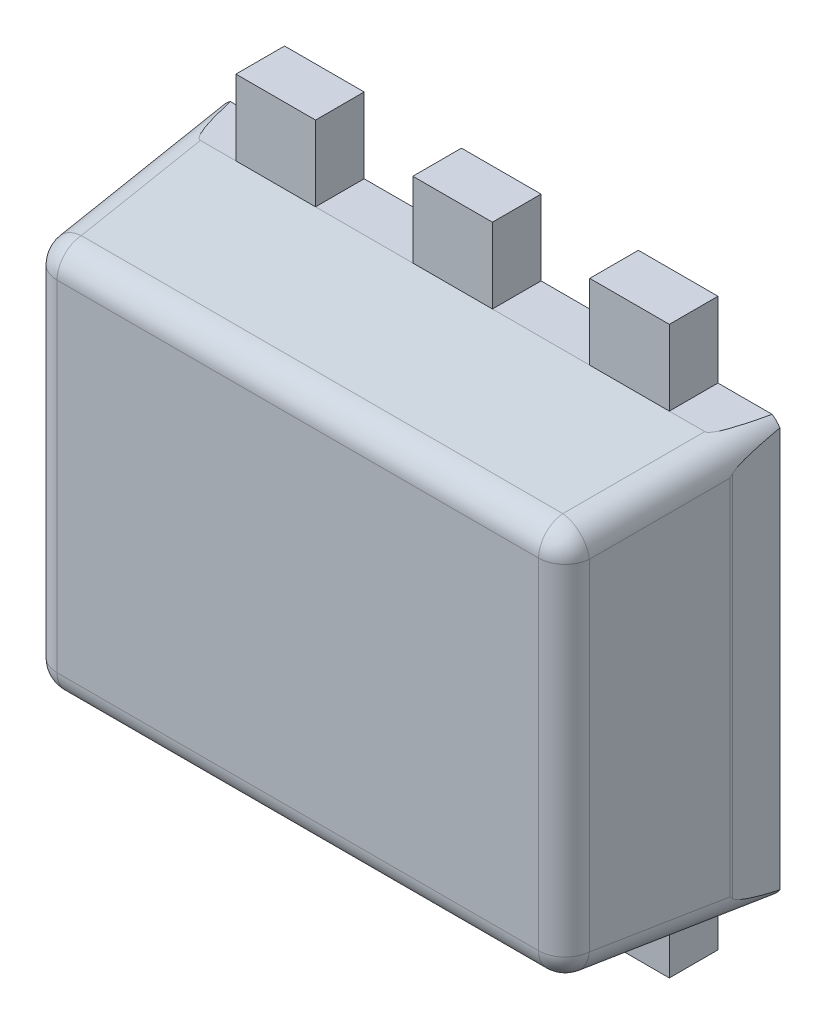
ISO-10303-21;
HEADER;
FILE_DESCRIPTION(('STEP AP214'),'2;1');
FILE_NAME('part.step','',(''),(''),'','','');
FILE_SCHEMA(('AUTOMOTIVE_DESIGN { 1 0 10303 214 1 1 1 1 }'));
ENDSEC;
DATA;
#1=APPLICATION_CONTEXT('core data for automotive mechanical design processes');
#2=APPLICATION_PROTOCOL_DEFINITION('international standard','automotive_design',2000,#1);
#3=PRODUCT_CONTEXT('',#1,'mechanical');
#4=PRODUCT('Part','Part','',(#3));
#5=PRODUCT_RELATED_PRODUCT_CATEGORY('part','',(#4));
#6=PRODUCT_DEFINITION_FORMATION('','',#4);
#7=PRODUCT_DEFINITION_CONTEXT('part definition',#1,'design');
#8=PRODUCT_DEFINITION('design','',#6,#7);
#9=PRODUCT_DEFINITION_SHAPE('','',#8);
#10=(LENGTH_UNIT() NAMED_UNIT(*) SI_UNIT(.MILLI.,.METRE.));
#11=(NAMED_UNIT(*) PLANE_ANGLE_UNIT() SI_UNIT($,.RADIAN.));
#12=(NAMED_UNIT(*) SI_UNIT($,.STERADIAN.) SOLID_ANGLE_UNIT());
#13=UNCERTAINTY_MEASURE_WITH_UNIT(LENGTH_MEASURE(1.E-05),#10,'distance_accuracy_value','');
#14=(GEOMETRIC_REPRESENTATION_CONTEXT(3) GLOBAL_UNCERTAINTY_ASSIGNED_CONTEXT((#13)) GLOBAL_UNIT_ASSIGNED_CONTEXT((#10,
#11,#12)) REPRESENTATION_CONTEXT('',''));
#15=CARTESIAN_POINT('',(0.,0.,0.));
#16=DIRECTION('',(0.,0.,1.));
#17=DIRECTION('',(1.,0.,0.));
#18=AXIS2_PLACEMENT_3D('',#15,#16,#17);
#19=CARTESIAN_POINT('',(-0.800059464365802,0.596940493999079,0.139700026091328));
#20=DIRECTION('',(1.74845553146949E-07,-0.999999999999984,-4.37113882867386E-08));
#21=DIRECTION('',(0.999999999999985,1.74845553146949E-07,0.));
#22=AXIS2_PLACEMENT_3D('',#19,#20,#21);
#23=PLANE('',#22);
#24=DIRECTION('',(0.,4.37113882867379E-08,-0.999999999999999));
#25=VECTOR('',#24,1.);
#26=CARTESIAN_POINT('',(0.622340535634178,0.596940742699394,0.139700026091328));
#27=LINE('',#26,#25);
#28=CARTESIAN_POINT('',(0.622340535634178,0.596940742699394,0.139700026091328));
#29=VERTEX_POINT('',#28);
#30=CARTESIAN_POINT('',(0.622340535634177,0.596940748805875,2.60913276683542E-08));
#31=VERTEX_POINT('',#30);
#32=EDGE_CURVE('E11',#29,#31,#27,.T.);
#33=ORIENTED_EDGE('',*,*,#32,.F.);
#34=DIRECTION('',(-0.999999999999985,-1.74845553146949E-07,0.));
#35=VECTOR('',#34,1.);
#36=CARTESIAN_POINT('',(-0.800059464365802,0.596940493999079,0.139700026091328));
#37=LINE('',#36,#35);
#38=CARTESIAN_POINT('',(0.724230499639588,0.596940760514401,0.139700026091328));
#39=VERTEX_POINT('',#38);
#40=EDGE_CURVE('E24',#39,#29,#37,.T.);
#41=ORIENTED_EDGE('',*,*,#40,.F.);
#42=CARTESIAN_POINT('',(0.724230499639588,0.596940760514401,0.139700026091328));
#43=CARTESIAN_POINT('',(0.739046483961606,0.59694076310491,0.13970002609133));
#44=CARTESIAN_POINT('',(0.757414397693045,0.596940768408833,0.0918320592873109));
#45=CARTESIAN_POINT('',(0.777836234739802,0.596940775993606,2.60913276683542E-08));
#46=(BOUNDED_CURVE() B_SPLINE_CURVE(3,(#42,#43,#44,#45),.UNSPECIFIED.,.F.,
.F.) B_SPLINE_CURVE_WITH_KNOTS((4,4),(3.14918885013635,3.72230655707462),
.UNSPECIFIED.) CURVE() GEOMETRIC_REPRESENTATION_ITEM() RATIONAL_B_SPLINE_CURVE((1.,
0.972814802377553,0.972814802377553,1.)) REPRESENTATION_ITEM(''));
#47=CARTESIAN_POINT('',(0.777836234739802,0.596940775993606,2.60913276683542E-08));
#48=VERTEX_POINT('',#47);
#49=EDGE_CURVE('E672',#39,#48,#46,.T.);
#50=ORIENTED_EDGE('',*,*,#49,.T.);
#51=DIRECTION('',(-0.999999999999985,-1.74845553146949E-07,0.));
#52=VECTOR('',#51,1.);
#53=CARTESIAN_POINT('',(-0.800059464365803,0.59694050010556,2.60913276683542E-08));
#54=LINE('',#53,#52);
#55=EDGE_CURVE('E670',#48,#31,#54,.T.);
#56=ORIENTED_EDGE('',*,*,#55,.T.);
#57=EDGE_LOOP('',(#33,#41,#50,#56));
#58=FACE_BOUND('',#57,.T.);
#59=ADVANCED_FACE('F17',(#58),#23,.F.);
#60=CARTESIAN_POINT('',(-0.800059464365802,0.596940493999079,0.139700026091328));
#61=DIRECTION('',(1.74845553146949E-07,-0.999999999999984,-4.37113882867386E-08));
#62=DIRECTION('',(0.999999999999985,1.74845553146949E-07,0.));
#63=AXIS2_PLACEMENT_3D('',#60,#61,#62);
#64=PLANE('',#63);
#65=DIRECTION('',(0.,4.37113882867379E-08,-0.999999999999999));
#66=VECTOR('',#65,1.);
#67=CARTESIAN_POINT('',(0.393740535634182,0.5969407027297,0.139700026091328));
#68=LINE('',#67,#66);
#69=CARTESIAN_POINT('',(0.393740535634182,0.5969407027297,0.139700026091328));
#70=VERTEX_POINT('',#69);
#71=CARTESIAN_POINT('',(0.393740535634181,0.596940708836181,2.60913276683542E-08));
#72=VERTEX_POINT('',#71);
#73=EDGE_CURVE('E284',#70,#72,#68,.T.);
#74=ORIENTED_EDGE('',*,*,#73,.T.);
#75=DIRECTION('',(-0.999999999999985,-1.74845553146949E-07,0.));
#76=VECTOR('',#75,1.);
#77=CARTESIAN_POINT('',(-0.800059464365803,0.59694050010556,2.60913276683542E-08));
#78=LINE('',#77,#76);
#79=CARTESIAN_POINT('',(0.114340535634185,0.596940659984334,2.60913276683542E-08));
#80=VERTEX_POINT('',#79);
#81=EDGE_CURVE('E667',#72,#80,#78,.T.);
#82=ORIENTED_EDGE('',*,*,#81,.T.);
#83=DIRECTION('',(0.,4.37113882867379E-08,-0.999999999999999));
#84=VECTOR('',#83,1.);
#85=CARTESIAN_POINT('',(0.114340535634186,0.596940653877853,0.139700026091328));
#86=LINE('',#85,#84);
#87=CARTESIAN_POINT('',(0.114340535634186,0.596940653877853,0.139700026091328));
#88=VERTEX_POINT('',#87);
#89=EDGE_CURVE('E664',#88,#80,#86,.T.);
#90=ORIENTED_EDGE('',*,*,#89,.F.);
#91=DIRECTION('',(-0.999999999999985,-1.74845553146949E-07,0.));
#92=VECTOR('',#91,1.);
#93=CARTESIAN_POINT('',(-0.800059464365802,0.596940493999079,0.139700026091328));
#94=LINE('',#93,#92);
#95=EDGE_CURVE('E661',#70,#88,#94,.T.);
#96=ORIENTED_EDGE('',*,*,#95,.F.);
#97=EDGE_LOOP('',(#74,#82,#90,#96));
#98=FACE_BOUND('',#97,.T.);
#99=ADVANCED_FACE('F691',(#98),#64,.F.);
#100=CARTESIAN_POINT('',(-0.800059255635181,-0.596859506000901,0.139699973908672));
#101=DIRECTION('',(-1.74845553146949E-07,0.999999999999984,4.37113882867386E-08));
#102=DIRECTION('',(-0.999999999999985,-1.74845553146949E-07,0.));
#103=AXIS2_PLACEMENT_3D('',#100,#101,#102);
#104=PLANE('',#103);
#105=DIRECTION('',(0.,4.37113882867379E-08,-0.999999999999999));
#106=VECTOR('',#105,1.);
#107=CARTESIAN_POINT('',(0.393740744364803,-0.596859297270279,0.139699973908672));
#108=LINE('',#107,#106);
#109=CARTESIAN_POINT('',(0.393740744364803,-0.596859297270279,0.139699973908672));
#110=VERTEX_POINT('',#109);
#111=CARTESIAN_POINT('',(0.393740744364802,-0.596859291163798,-2.60913276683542E-08));
#112=VERTEX_POINT('',#111);
#113=EDGE_CURVE('E659',#110,#112,#108,.T.);
#114=ORIENTED_EDGE('',*,*,#113,.F.);
#115=DIRECTION('',(0.999999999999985,1.74845553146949E-07,0.));
#116=VECTOR('',#115,1.);
#117=CARTESIAN_POINT('',(-0.800059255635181,-0.596859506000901,0.139699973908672));
#118=LINE('',#117,#116);
#119=CARTESIAN_POINT('',(0.114340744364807,-0.596859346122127,0.139699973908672));
#120=VERTEX_POINT('',#119);
#121=EDGE_CURVE('E656',#120,#110,#118,.T.);
#122=ORIENTED_EDGE('',*,*,#121,.F.);
#123=DIRECTION('',(0.,4.37113882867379E-08,-0.999999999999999));
#124=VECTOR('',#123,1.);
#125=CARTESIAN_POINT('',(0.114340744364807,-0.596859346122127,0.139699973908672));
#126=LINE('',#125,#124);
#127=CARTESIAN_POINT('',(0.114340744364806,-0.596859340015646,-2.60913276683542E-08));
#128=VERTEX_POINT('',#127);
#129=EDGE_CURVE('E654',#120,#128,#126,.T.);
#130=ORIENTED_EDGE('',*,*,#129,.T.);
#131=DIRECTION('',(0.999999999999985,1.74845553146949E-07,0.));
#132=VECTOR('',#131,1.);
#133=CARTESIAN_POINT('',(-0.800059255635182,-0.59685949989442,-2.60913276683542E-08));
#134=LINE('',#133,#132);
#135=EDGE_CURVE('E651',#128,#112,#134,.T.);
#136=ORIENTED_EDGE('',*,*,#135,.T.);
#137=EDGE_LOOP('',(#114,#122,#130,#136));
#138=FACE_BOUND('',#137,.T.);
#139=ADVANCED_FACE('F769',(#138),#104,.F.);
#140=CARTESIAN_POINT('',(-0.800059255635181,-0.596859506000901,0.139699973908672));
#141=DIRECTION('',(-1.74845553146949E-07,0.999999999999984,4.37113882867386E-08));
#142=DIRECTION('',(-0.999999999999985,-1.74845553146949E-07,0.));
#143=AXIS2_PLACEMENT_3D('',#140,#141,#142);
#144=PLANE('',#143);
#145=DIRECTION('',(0.,4.37113882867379E-08,-0.999999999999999));
#146=VECTOR('',#145,1.);
#147=CARTESIAN_POINT('',(0.6223407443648,-0.596859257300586,0.139699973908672));
#148=LINE('',#147,#146);
#149=CARTESIAN_POINT('',(0.6223407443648,-0.596859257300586,0.139699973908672));
#150=VERTEX_POINT('',#149);
#151=CARTESIAN_POINT('',(0.622340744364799,-0.596859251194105,-2.60913276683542E-08));
#152=VERTEX_POINT('',#151);
#153=EDGE_CURVE('E649',#150,#152,#148,.T.);
#154=ORIENTED_EDGE('',*,*,#153,.T.);
#155=DIRECTION('',(0.999999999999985,1.74845553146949E-07,0.));
#156=VECTOR('',#155,1.);
#157=CARTESIAN_POINT('',(-0.800059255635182,-0.59685949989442,-2.60913276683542E-08));
#158=LINE('',#157,#156);
#159=CARTESIAN_POINT('',(0.777836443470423,-0.596859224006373,-2.60913276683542E-08));
#160=VERTEX_POINT('',#159);
#161=EDGE_CURVE('E643',#152,#160,#158,.T.);
#162=ORIENTED_EDGE('',*,*,#161,.T.);
#163=CARTESIAN_POINT('',(0.777836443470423,-0.596859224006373,-2.60913276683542E-08));
#164=CARTESIAN_POINT('',(0.757414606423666,-0.596859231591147,0.0918320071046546));
#165=CARTESIAN_POINT('',(0.739046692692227,-0.59685923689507,0.139699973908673));
#166=CARTESIAN_POINT('',(0.724230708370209,-0.596859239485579,0.139699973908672));
#167=(BOUNDED_CURVE() B_SPLINE_CURVE(3,(#163,#164,#165,#166),.UNSPECIFIED.,.F.,
.F.) B_SPLINE_CURVE_WITH_KNOTS((4,4),(2.56087875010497,3.13399645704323),
.UNSPECIFIED.) CURVE() GEOMETRIC_REPRESENTATION_ITEM() RATIONAL_B_SPLINE_CURVE((1.,
0.972814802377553,0.972814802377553,1.)) REPRESENTATION_ITEM(''));
#168=CARTESIAN_POINT('',(0.724230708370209,-0.596859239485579,0.139699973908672));
#169=VERTEX_POINT('',#168);
#170=EDGE_CURVE('E639',#160,#169,#167,.T.);
#171=ORIENTED_EDGE('',*,*,#170,.T.);
#172=DIRECTION('',(0.999999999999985,1.74845553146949E-07,0.));
#173=VECTOR('',#172,1.);
#174=CARTESIAN_POINT('',(-0.800059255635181,-0.596859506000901,0.139699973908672));
#175=LINE('',#174,#173);
#176=EDGE_CURVE('E636',#150,#169,#175,.T.);
#177=ORIENTED_EDGE('',*,*,#176,.F.);
#178=EDGE_LOOP('',(#154,#162,#171,#177));
#179=FACE_BOUND('',#178,.T.);
#180=ADVANCED_FACE('F773',(#179),#144,.F.);
#181=CARTESIAN_POINT('',(-0.800059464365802,0.596940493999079,0.139700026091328));
#182=DIRECTION('',(1.74845553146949E-07,-0.999999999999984,-4.37113882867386E-08));
#183=DIRECTION('',(0.999999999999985,1.74845553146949E-07,0.));
#184=AXIS2_PLACEMENT_3D('',#181,#182,#183);
#185=PLANE('',#184);
#186=DIRECTION('',(0.,4.37113882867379E-08,-0.999999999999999));
#187=VECTOR('',#186,1.);
#188=CARTESIAN_POINT('',(-0.393659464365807,0.596940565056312,0.139700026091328));
#189=LINE('',#188,#187);
#190=CARTESIAN_POINT('',(-0.393659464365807,0.596940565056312,0.139700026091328));
#191=VERTEX_POINT('',#190);
#192=CARTESIAN_POINT('',(-0.393659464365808,0.596940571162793,2.60913276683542E-08));
#193=VERTEX_POINT('',#192);
#194=EDGE_CURVE('E634',#191,#193,#189,.T.);
#195=ORIENTED_EDGE('',*,*,#194,.F.);
#196=DIRECTION('',(-0.999999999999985,-1.74845553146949E-07,0.));
#197=VECTOR('',#196,1.);
#198=CARTESIAN_POINT('',(-0.800059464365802,0.596940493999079,0.139700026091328));
#199=LINE('',#198,#197);
#200=CARTESIAN_POINT('',(-0.114259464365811,0.596940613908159,0.139700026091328));
#201=VERTEX_POINT('',#200);
#202=EDGE_CURVE('E631',#201,#191,#199,.T.);
#203=ORIENTED_EDGE('',*,*,#202,.F.);
#204=DIRECTION('',(0.,4.37113882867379E-08,-0.999999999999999));
#205=VECTOR('',#204,1.);
#206=CARTESIAN_POINT('',(-0.114259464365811,0.596940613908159,0.139700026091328));
#207=LINE('',#206,#205);
#208=CARTESIAN_POINT('',(-0.114259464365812,0.59694062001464,2.60913276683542E-08));
#209=VERTEX_POINT('',#208);
#210=EDGE_CURVE('E629',#201,#209,#207,.T.);
#211=ORIENTED_EDGE('',*,*,#210,.T.);
#212=DIRECTION('',(-0.999999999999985,-1.74845553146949E-07,0.));
#213=VECTOR('',#212,1.);
#214=CARTESIAN_POINT('',(-0.800059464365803,0.59694050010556,2.60913276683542E-08));
#215=LINE('',#214,#213);
#216=EDGE_CURVE('E626',#209,#193,#215,.T.);
#217=ORIENTED_EDGE('',*,*,#216,.T.);
#218=EDGE_LOOP('',(#195,#203,#211,#217));
#219=FACE_BOUND('',#218,.T.);
#220=ADVANCED_FACE('F710',(#219),#185,.F.);
#221=CARTESIAN_POINT('',(-0.800059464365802,0.596940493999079,0.139700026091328));
#222=DIRECTION('',(1.74845553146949E-07,-0.999999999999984,-4.37113882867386E-08));
#223=DIRECTION('',(0.999999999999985,1.74845553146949E-07,0.));
#224=AXIS2_PLACEMENT_3D('',#221,#222,#223);
#225=PLANE('',#224);
#226=DIRECTION('',(0.,4.37113882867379E-08,-0.999999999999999));
#227=VECTOR('',#226,1.);
#228=CARTESIAN_POINT('',(-0.622259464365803,0.596940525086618,0.139700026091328));
#229=LINE('',#228,#227);
#230=CARTESIAN_POINT('',(-0.622259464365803,0.596940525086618,0.139700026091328));
#231=VERTEX_POINT('',#230);
#232=CARTESIAN_POINT('',(-0.622259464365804,0.596940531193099,2.60913276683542E-08));
#233=VERTEX_POINT('',#232);
#234=EDGE_CURVE('E623',#231,#233,#229,.T.);
#235=ORIENTED_EDGE('',*,*,#234,.T.);
#236=DIRECTION('',(-0.999999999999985,-1.74845553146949E-07,0.));
#237=VECTOR('',#236,1.);
#238=CARTESIAN_POINT('',(-0.800059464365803,0.59694050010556,2.60913276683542E-08));
#239=LINE('',#238,#237);
#240=CARTESIAN_POINT('',(-0.777755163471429,0.596940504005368,2.60913276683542E-08));
#241=VERTEX_POINT('',#240);
#242=EDGE_CURVE('E618',#233,#241,#239,.T.);
#243=ORIENTED_EDGE('',*,*,#242,.T.);
#244=CARTESIAN_POINT('',(-0.777755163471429,0.596940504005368,2.60913276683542E-08));
#245=CARTESIAN_POINT('',(-0.75733332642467,0.596940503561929,0.0918320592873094));
#246=CARTESIAN_POINT('',(-0.738965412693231,0.596940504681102,0.139700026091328));
#247=CARTESIAN_POINT('',(-0.724149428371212,0.596940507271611,0.139700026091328));
#248=(BOUNDED_CURVE() B_SPLINE_CURVE(3,(#244,#245,#246,#247),.UNSPECIFIED.,.F.,
.F.) B_SPLINE_CURVE_WITH_KNOTS((4,4),(2.56087875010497,3.13399645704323),
.UNSPECIFIED.) CURVE() GEOMETRIC_REPRESENTATION_ITEM() RATIONAL_B_SPLINE_CURVE((1.,
0.972814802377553,0.972814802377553,1.)) REPRESENTATION_ITEM(''));
#249=CARTESIAN_POINT('',(-0.724149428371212,0.596940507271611,0.139700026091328));
#250=VERTEX_POINT('',#249);
#251=EDGE_CURVE('E613',#241,#250,#248,.T.);
#252=ORIENTED_EDGE('',*,*,#251,.T.);
#253=DIRECTION('',(-0.999999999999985,-1.74845553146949E-07,0.));
#254=VECTOR('',#253,1.);
#255=CARTESIAN_POINT('',(-0.800059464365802,0.596940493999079,0.139700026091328));
#256=LINE('',#255,#254);
#257=EDGE_CURVE('E610',#231,#250,#256,.T.);
#258=ORIENTED_EDGE('',*,*,#257,.F.);
#259=EDGE_LOOP('',(#235,#243,#252,#258));
#260=FACE_BOUND('',#259,.T.);
#261=ADVANCED_FACE('F721',(#260),#225,.F.);
#262=CARTESIAN_POINT('',(-0.800059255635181,-0.596859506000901,0.139699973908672));
#263=DIRECTION('',(-1.74845553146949E-07,0.999999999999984,4.37113882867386E-08));
#264=DIRECTION('',(-0.999999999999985,-1.74845553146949E-07,0.));
#265=AXIS2_PLACEMENT_3D('',#262,#263,#264);
#266=PLANE('',#265);
#267=DIRECTION('',(0.,4.37113882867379E-08,-0.999999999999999));
#268=VECTOR('',#267,1.);
#269=CARTESIAN_POINT('',(-0.622259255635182,-0.596859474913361,0.139699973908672));
#270=LINE('',#269,#268);
#271=CARTESIAN_POINT('',(-0.622259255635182,-0.596859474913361,0.139699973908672));
#272=VERTEX_POINT('',#271);
#273=CARTESIAN_POINT('',(-0.622259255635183,-0.59685946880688,-2.60913276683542E-08));
#274=VERTEX_POINT('',#273);
#275=EDGE_CURVE('E608',#272,#274,#270,.T.);
#276=ORIENTED_EDGE('',*,*,#275,.F.);
#277=DIRECTION('',(0.999999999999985,1.74845553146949E-07,0.));
#278=VECTOR('',#277,1.);
#279=CARTESIAN_POINT('',(-0.800059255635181,-0.596859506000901,0.139699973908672));
#280=LINE('',#279,#278);
#281=CARTESIAN_POINT('',(-0.724149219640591,-0.596859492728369,0.139699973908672));
#282=VERTEX_POINT('',#281);
#283=EDGE_CURVE('E602',#282,#272,#280,.T.);
#284=ORIENTED_EDGE('',*,*,#283,.F.);
#285=CARTESIAN_POINT('',(-0.724149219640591,-0.596859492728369,0.139699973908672));
#286=CARTESIAN_POINT('',(-0.738965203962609,-0.596859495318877,0.139699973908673));
#287=CARTESIAN_POINT('',(-0.757333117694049,-0.59685949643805,0.0918320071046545));
#288=CARTESIAN_POINT('',(-0.777754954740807,-0.596859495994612,-2.60913276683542E-08));
#289=(BOUNDED_CURVE() B_SPLINE_CURVE(3,(#285,#286,#287,#288),.UNSPECIFIED.,.F.,
.F.) B_SPLINE_CURVE_WITH_KNOTS((4,4),(3.14918885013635,3.72230655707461),
.UNSPECIFIED.) CURVE() GEOMETRIC_REPRESENTATION_ITEM() RATIONAL_B_SPLINE_CURVE((1.,
0.972814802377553,0.972814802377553,1.)) REPRESENTATION_ITEM(''));
#290=CARTESIAN_POINT('',(-0.777754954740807,-0.596859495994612,-2.60913276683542E-08));
#291=VERTEX_POINT('',#290);
#292=EDGE_CURVE('E597',#282,#291,#289,.T.);
#293=ORIENTED_EDGE('',*,*,#292,.T.);
#294=DIRECTION('',(0.999999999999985,1.74845553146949E-07,0.));
#295=VECTOR('',#294,1.);
#296=CARTESIAN_POINT('',(-0.800059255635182,-0.59685949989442,-2.60913276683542E-08));
#297=LINE('',#296,#295);
#298=EDGE_CURVE('E594',#291,#274,#297,.T.);
#299=ORIENTED_EDGE('',*,*,#298,.T.);
#300=EDGE_LOOP('',(#276,#284,#293,#299));
#301=FACE_BOUND('',#300,.T.);
#302=ADVANCED_FACE('F784',(#301),#266,.F.);
#303=CARTESIAN_POINT('',(-0.800059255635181,-0.596859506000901,0.139699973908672));
#304=DIRECTION('',(-1.74845553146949E-07,0.999999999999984,4.37113882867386E-08));
#305=DIRECTION('',(-0.999999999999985,-1.74845553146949E-07,0.));
#306=AXIS2_PLACEMENT_3D('',#303,#304,#305);
#307=PLANE('',#306);
#308=DIRECTION('',(0.,4.37113882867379E-08,-0.999999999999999));
#309=VECTOR('',#308,1.);
#310=CARTESIAN_POINT('',(-0.393659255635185,-0.596859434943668,0.139699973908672));
#311=LINE('',#310,#309);
#312=CARTESIAN_POINT('',(-0.393659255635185,-0.596859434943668,0.139699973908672));
#313=VERTEX_POINT('',#312);
#314=CARTESIAN_POINT('',(-0.393659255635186,-0.596859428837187,-2.60913276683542E-08));
#315=VERTEX_POINT('',#314);
#316=EDGE_CURVE('E591',#313,#315,#311,.T.);
#317=ORIENTED_EDGE('',*,*,#316,.T.);
#318=DIRECTION('',(0.999999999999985,1.74845553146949E-07,0.));
#319=VECTOR('',#318,1.);
#320=CARTESIAN_POINT('',(-0.800059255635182,-0.59685949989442,-2.60913276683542E-08));
#321=LINE('',#320,#319);
#322=CARTESIAN_POINT('',(-0.11425925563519,-0.59685937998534,-2.60913276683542E-08));
#323=VERTEX_POINT('',#322);
#324=EDGE_CURVE('E588',#315,#323,#321,.T.);
#325=ORIENTED_EDGE('',*,*,#324,.T.);
#326=DIRECTION('',(0.,4.37113882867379E-08,-0.999999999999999));
#327=VECTOR('',#326,1.);
#328=CARTESIAN_POINT('',(-0.114259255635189,-0.59685938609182,0.139699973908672));
#329=LINE('',#328,#327);
#330=CARTESIAN_POINT('',(-0.114259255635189,-0.59685938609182,0.139699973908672));
#331=VERTEX_POINT('',#330);
#332=EDGE_CURVE('E585',#331,#323,#329,.T.);
#333=ORIENTED_EDGE('',*,*,#332,.F.);
#334=DIRECTION('',(0.999999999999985,1.74845553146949E-07,0.));
#335=VECTOR('',#334,1.);
#336=CARTESIAN_POINT('',(-0.800059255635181,-0.596859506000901,0.139699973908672));
#337=LINE('',#336,#335);
#338=EDGE_CURVE('E582',#313,#331,#337,.T.);
#339=ORIENTED_EDGE('',*,*,#338,.F.);
#340=EDGE_LOOP('',(#317,#325,#333,#339));
#341=FACE_BOUND('',#340,.T.);
#342=ADVANCED_FACE('F787',(#341),#307,.F.);
#343=CARTESIAN_POINT('',(-0.800059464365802,0.596940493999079,0.139700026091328));
#344=DIRECTION('',(0.999999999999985,1.74845553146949E-07,0.));
#345=DIRECTION('',(-1.74845553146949E-07,0.999999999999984,4.37113882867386E-08));
#346=AXIS2_PLACEMENT_3D('',#343,#344,#345);
#347=PLANE('',#346);
#348=DIRECTION('',(1.74845553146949E-07,-0.999999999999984,-4.37113882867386E-08));
#349=VECTOR('',#348,1.);
#350=CARTESIAN_POINT('',(-0.800059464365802,0.596940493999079,0.139700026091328));
#351=LINE('',#350,#349);
#352=CARTESIAN_POINT('',(-0.80005945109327,0.521030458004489,0.139700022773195));
#353=VERTEX_POINT('',#352);
#354=CARTESIAN_POINT('',(-0.800059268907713,-0.520949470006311,0.139699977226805));
#355=VERTEX_POINT('',#354);
#356=EDGE_CURVE('E576',#353,#355,#351,.T.);
#357=ORIENTED_EDGE('',*,*,#356,.F.);
#358=CARTESIAN_POINT('',(-0.80005945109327,0.521030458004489,0.139700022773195));
#359=CARTESIAN_POINT('',(-0.800059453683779,0.535846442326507,0.139700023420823));
#360=CARTESIAN_POINT('',(-0.800059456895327,0.554214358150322,0.0918320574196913));
#361=CARTESIAN_POINT('',(-0.800059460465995,0.574636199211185,2.5116375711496E-08));
#362=(BOUNDED_CURVE() B_SPLINE_CURVE(3,(#358,#359,#360,#361),.UNSPECIFIED.,.F.,
.F.) B_SPLINE_CURVE_WITH_KNOTS((4,4),(3.14918885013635,3.72230655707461),
.UNSPECIFIED.) CURVE() GEOMETRIC_REPRESENTATION_ITEM() RATIONAL_B_SPLINE_CURVE((1.,
0.972814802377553,0.972814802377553,1.)) REPRESENTATION_ITEM(''));
#363=CARTESIAN_POINT('',(-0.800059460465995,0.574636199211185,2.5116375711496E-08));
#364=VERTEX_POINT('',#363);
#365=EDGE_CURVE('E572',#353,#364,#362,.T.);
#366=ORIENTED_EDGE('',*,*,#365,.T.);
#367=DIRECTION('',(1.74845553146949E-07,-0.999999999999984,-4.37113882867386E-08));
#368=VECTOR('',#367,1.);
#369=CARTESIAN_POINT('',(-0.800059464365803,0.59694050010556,2.60913276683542E-08));
#370=LINE('',#369,#368);
#371=CARTESIAN_POINT('',(-0.80005925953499,-0.574555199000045,-2.51163757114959E-08));
#372=VERTEX_POINT('',#371);
#373=EDGE_CURVE('E567',#364,#372,#370,.T.);
#374=ORIENTED_EDGE('',*,*,#373,.T.);
#375=CARTESIAN_POINT('',(-0.80005925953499,-0.574555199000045,-2.51163757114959E-08));
#376=CARTESIAN_POINT('',(-0.800059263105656,-0.554133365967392,0.0918320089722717));
#377=CARTESIAN_POINT('',(-0.800059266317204,-0.535765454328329,0.139699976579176));
#378=CARTESIAN_POINT('',(-0.800059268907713,-0.520949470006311,0.139699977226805));
#379=(BOUNDED_CURVE() B_SPLINE_CURVE(3,(#375,#376,#377,#378),.UNSPECIFIED.,.F.,
.F.) B_SPLINE_CURVE_WITH_KNOTS((4,4),(2.56087875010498,3.13399645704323),
.UNSPECIFIED.) CURVE() GEOMETRIC_REPRESENTATION_ITEM() RATIONAL_B_SPLINE_CURVE((1.,
0.972814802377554,0.972814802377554,1.)) REPRESENTATION_ITEM(''));
#380=EDGE_CURVE('E562',#372,#355,#379,.T.);
#381=ORIENTED_EDGE('',*,*,#380,.T.);
#382=EDGE_LOOP('',(#357,#366,#374,#381));
#383=FACE_BOUND('',#382,.T.);
#384=ADVANCED_FACE('F791',(#383),#347,.F.);
#385=CARTESIAN_POINT('',(0.800140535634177,0.596940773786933,0.139700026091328));
#386=DIRECTION('',(-0.999999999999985,-1.74845553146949E-07,0.));
#387=DIRECTION('',(1.74845553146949E-07,-0.999999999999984,-4.37113882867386E-08));
#388=AXIS2_PLACEMENT_3D('',#385,#386,#387);
#389=PLANE('',#388);
#390=DIRECTION('',(1.74845553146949E-07,-0.999999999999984,-4.37113882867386E-08));
#391=VECTOR('',#390,1.);
#392=CARTESIAN_POINT('',(0.800140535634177,0.596940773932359,0.136373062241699));
#393=LINE('',#392,#391);
#394=CARTESIAN_POINT('',(0.800140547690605,0.527986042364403,0.136373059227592));
#395=VERTEX_POINT('',#394);
#396=CARTESIAN_POINT('',(0.80014073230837,-0.527904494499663,0.136373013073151));
#397=VERTEX_POINT('',#396);
#398=EDGE_CURVE('E556',#395,#397,#393,.T.);
#399=ORIENTED_EDGE('',*,*,#398,.T.);
#400=CARTESIAN_POINT('',(0.80014073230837,-0.527904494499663,0.136373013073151));
#401=CARTESIAN_POINT('',(0.800140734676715,-0.541449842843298,0.1239094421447));
#402=CARTESIAN_POINT('',(0.80014073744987,-0.557310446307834,0.0775441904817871));
#403=CARTESIAN_POINT('',(0.80014074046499,-0.574554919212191,-2.51163757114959E-08));
#404=(BOUNDED_CURVE() B_SPLINE_CURVE(3,(#400,#401,#402,#403),.UNSPECIFIED.,.F.,
.F.) B_SPLINE_CURVE_WITH_KNOTS((4,4),(3.23645531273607,3.72230655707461),
.UNSPECIFIED.) CURVE() GEOMETRIC_REPRESENTATION_ITEM() RATIONAL_B_SPLINE_CURVE((1.,
0.980425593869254,0.980425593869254,1.)) REPRESENTATION_ITEM(''));
#405=CARTESIAN_POINT('',(0.80014074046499,-0.574554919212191,-2.51163757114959E-08));
#406=VERTEX_POINT('',#405);
#407=EDGE_CURVE('E552',#397,#406,#404,.T.);
#408=ORIENTED_EDGE('',*,*,#407,.T.);
#409=DIRECTION('',(-1.74845553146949E-07,0.999999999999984,4.37113882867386E-08));
#410=VECTOR('',#409,1.);
#411=CARTESIAN_POINT('',(0.800140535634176,0.596940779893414,2.60913276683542E-08));
#412=LINE('',#411,#410);
#413=CARTESIAN_POINT('',(0.800140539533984,0.57463647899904,2.5116375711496E-08));
#414=VERTEX_POINT('',#413);
#415=EDGE_CURVE('E546',#406,#414,#412,.T.);
#416=ORIENTED_EDGE('',*,*,#415,.T.);
#417=CARTESIAN_POINT('',(0.800140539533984,0.57463647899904,2.5116375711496E-08));
#418=CARTESIAN_POINT('',(0.800140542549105,0.557391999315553,0.077544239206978));
#419=CARTESIAN_POINT('',(0.800140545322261,0.541531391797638,0.123909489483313));
#420=CARTESIAN_POINT('',(0.800140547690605,0.527986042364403,0.136373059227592));
#421=(BOUNDED_CURVE() B_SPLINE_CURVE(3,(#417,#418,#419,#420),.UNSPECIFIED.,.F.,
.F.) B_SPLINE_CURVE_WITH_KNOTS((4,4),(2.56087875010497,3.04672999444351),
.UNSPECIFIED.) CURVE() GEOMETRIC_REPRESENTATION_ITEM() RATIONAL_B_SPLINE_CURVE((1.,
0.980425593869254,0.980425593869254,1.)) REPRESENTATION_ITEM(''));
#422=EDGE_CURVE('E541',#414,#395,#421,.T.);
#423=ORIENTED_EDGE('',*,*,#422,.T.);
#424=EDGE_LOOP('',(#399,#408,#416,#423));
#425=FACE_BOUND('',#424,.T.);
#426=ADVANCED_FACE('F762',(#425),#389,.F.);
#427=CARTESIAN_POINT('',(-0.800059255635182,-0.59685949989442,-2.60913276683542E-08));
#428=DIRECTION('',(0.,-4.37113882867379E-08,0.999999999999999));
#429=DIRECTION('',(1.74845553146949E-07,-0.999999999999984,-4.37113882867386E-08));
#430=AXIS2_PLACEMENT_3D('',#427,#428,#429);
#431=PLANE('',#430);
#432=DIRECTION('',(-1.74845553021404E-07,0.999999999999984,4.37113882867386E-08));
#433=VECTOR('',#432,1.);
#434=CARTESIAN_POINT('',(0.114340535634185,0.596940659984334,2.60913276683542E-08));
#435=LINE('',#434,#433);
#436=CARTESIAN_POINT('',(0.11434049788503,0.812840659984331,3.55286163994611E-08));
#437=VERTEX_POINT('',#436);
#438=EDGE_CURVE('E538',#80,#437,#435,.T.);
#439=ORIENTED_EDGE('',*,*,#438,.F.);
#440=ORIENTED_EDGE('',*,*,#81,.F.);
#441=DIRECTION('',(1.74845553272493E-07,-0.999999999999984,-4.37113882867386E-08));
#442=VECTOR('',#441,1.);
#443=CARTESIAN_POINT('',(0.393740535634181,0.596940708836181,2.60913276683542E-08));
#444=LINE('',#443,#442);
#445=CARTESIAN_POINT('',(0.393740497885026,0.812840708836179,3.55286163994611E-08));
#446=VERTEX_POINT('',#445);
#447=EDGE_CURVE('E536',#446,#72,#444,.T.);
#448=ORIENTED_EDGE('',*,*,#447,.F.);
#449=DIRECTION('',(-0.999999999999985,-1.74845553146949E-07,0.));
#450=VECTOR('',#449,1.);
#451=CARTESIAN_POINT('',(0.393740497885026,0.812840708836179,3.55286163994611E-08));
#452=LINE('',#451,#450);
#453=CARTESIAN_POINT('',(0.622340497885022,0.812840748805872,3.55286163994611E-08));
#454=VERTEX_POINT('',#453);
#455=EDGE_CURVE('E269',#454,#446,#452,.T.);
#456=ORIENTED_EDGE('',*,*,#455,.F.);
#457=DIRECTION('',(-1.74845553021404E-07,0.999999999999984,4.37113882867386E-08));
#458=VECTOR('',#457,1.);
#459=CARTESIAN_POINT('',(0.622340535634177,0.596940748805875,2.60913276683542E-08));
#460=LINE('',#459,#458);
#461=EDGE_CURVE('E530',#31,#454,#460,.T.);
#462=ORIENTED_EDGE('',*,*,#461,.F.);
#463=ORIENTED_EDGE('',*,*,#55,.F.);
#464=CARTESIAN_POINT('',(0.777836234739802,0.596940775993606,2.60913276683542E-08));
#465=CARTESIAN_POINT('',(0.786789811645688,0.591133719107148,2.58374930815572E-08));
#466=CARTESIAN_POINT('',(0.794333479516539,0.583590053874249,2.55077489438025E-08));
#467=CARTESIAN_POINT('',(0.800140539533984,0.57463647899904,2.5116375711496E-08));
#468=(BOUNDED_CURVE() B_SPLINE_CURVE(3,(#464,#465,#466,#467),.UNSPECIFIED.,.F.,
.F.) B_SPLINE_CURVE_WITH_KNOTS((4,4),(6.07470294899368,6.49166766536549),
.UNSPECIFIED.) CURVE() GEOMETRIC_REPRESENTATION_ITEM() RATIONAL_B_SPLINE_CURVE((1.,
0.985564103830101,0.985564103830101,1.)) REPRESENTATION_ITEM(''));
#469=EDGE_CURVE('E522',#48,#414,#468,.T.);
#470=ORIENTED_EDGE('',*,*,#469,.T.);
#471=ORIENTED_EDGE('',*,*,#415,.F.);
#472=CARTESIAN_POINT('',(0.80014074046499,-0.574554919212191,-2.51163757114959E-08));
#473=CARTESIAN_POINT('',(0.794333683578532,-0.583508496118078,-2.55077489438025E-08));
#474=CARTESIAN_POINT('',(0.786790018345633,-0.591052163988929,-2.58374930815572E-08));
#475=CARTESIAN_POINT('',(0.777836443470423,-0.596859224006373,-2.60913276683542E-08));
#476=(BOUNDED_CURVE() B_SPLINE_CURVE(3,(#472,#473,#474,#475),.UNSPECIFIED.,.F.,
.F.) B_SPLINE_CURVE_WITH_KNOTS((4,4),(6.07470294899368,6.49166766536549),
.UNSPECIFIED.) CURVE() GEOMETRIC_REPRESENTATION_ITEM() RATIONAL_B_SPLINE_CURVE((1.,
0.9855641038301,0.9855641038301,1.)) REPRESENTATION_ITEM(''));
#477=EDGE_CURVE('E517',#406,#160,#476,.T.);
#478=ORIENTED_EDGE('',*,*,#477,.T.);
#479=ORIENTED_EDGE('',*,*,#161,.F.);
#480=DIRECTION('',(-1.74845553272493E-07,0.999999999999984,4.37113882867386E-08));
#481=VECTOR('',#480,1.);
#482=CARTESIAN_POINT('',(0.622340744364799,-0.596859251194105,-2.60913276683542E-08));
#483=LINE('',#482,#481);
#484=CARTESIAN_POINT('',(0.622340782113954,-0.812759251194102,-3.55286163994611E-08));
#485=VERTEX_POINT('',#484);
#486=EDGE_CURVE('E514',#485,#152,#483,.T.);
#487=ORIENTED_EDGE('',*,*,#486,.F.);
#488=DIRECTION('',(0.999999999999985,1.74845553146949E-07,0.));
#489=VECTOR('',#488,1.);
#490=CARTESIAN_POINT('',(0.393740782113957,-0.812759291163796,-3.55286163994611E-08));
#491=LINE('',#490,#489);
#492=CARTESIAN_POINT('',(0.393740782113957,-0.812759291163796,-3.55286163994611E-08));
#493=VERTEX_POINT('',#492);
#494=EDGE_CURVE('E511',#493,#485,#491,.T.);
#495=ORIENTED_EDGE('',*,*,#494,.F.);
#496=DIRECTION('',(1.74845553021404E-07,-0.999999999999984,-4.37113882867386E-08));
#497=VECTOR('',#496,1.);
#498=CARTESIAN_POINT('',(0.393740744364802,-0.596859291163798,-2.60913276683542E-08));
#499=LINE('',#498,#497);
#500=EDGE_CURVE('E508',#112,#493,#499,.T.);
#501=ORIENTED_EDGE('',*,*,#500,.F.);
#502=ORIENTED_EDGE('',*,*,#135,.F.);
#503=DIRECTION('',(-1.74845553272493E-07,0.999999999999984,4.37113882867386E-08));
#504=VECTOR('',#503,1.);
#505=CARTESIAN_POINT('',(0.114340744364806,-0.596859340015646,-2.60913276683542E-08));
#506=LINE('',#505,#504);
#507=CARTESIAN_POINT('',(0.114340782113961,-0.812759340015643,-3.55286163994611E-08));
#508=VERTEX_POINT('',#507);
#509=EDGE_CURVE('E505',#508,#128,#506,.T.);
#510=ORIENTED_EDGE('',*,*,#509,.F.);
#511=DIRECTION('',(0.999999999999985,1.74845553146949E-07,0.));
#512=VECTOR('',#511,1.);
#513=CARTESIAN_POINT('',(-0.114259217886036,-0.812759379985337,-3.55286163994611E-08));
#514=LINE('',#513,#512);
#515=CARTESIAN_POINT('',(-0.114259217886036,-0.812759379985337,-3.55286163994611E-08));
#516=VERTEX_POINT('',#515);
#517=EDGE_CURVE('E502',#516,#508,#514,.T.);
#518=ORIENTED_EDGE('',*,*,#517,.F.);
#519=DIRECTION('',(1.74845553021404E-07,-0.999999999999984,-4.37113882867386E-08));
#520=VECTOR('',#519,1.);
#521=CARTESIAN_POINT('',(-0.11425925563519,-0.59685937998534,-2.60913276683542E-08));
#522=LINE('',#521,#520);
#523=EDGE_CURVE('E499',#323,#516,#522,.T.);
#524=ORIENTED_EDGE('',*,*,#523,.F.);
#525=ORIENTED_EDGE('',*,*,#324,.F.);
#526=DIRECTION('',(-1.74845553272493E-07,0.999999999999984,4.37113882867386E-08));
#527=VECTOR('',#526,1.);
#528=CARTESIAN_POINT('',(-0.393659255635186,-0.596859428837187,-2.60913276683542E-08));
#529=LINE('',#528,#527);
#530=CARTESIAN_POINT('',(-0.393659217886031,-0.812759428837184,-3.55286163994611E-08));
#531=VERTEX_POINT('',#530);
#532=EDGE_CURVE('E497',#531,#315,#529,.T.);
#533=ORIENTED_EDGE('',*,*,#532,.F.);
#534=DIRECTION('',(0.999999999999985,1.74845553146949E-07,0.));
#535=VECTOR('',#534,1.);
#536=CARTESIAN_POINT('',(-0.622259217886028,-0.812759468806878,-3.55286163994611E-08));
#537=LINE('',#536,#535);
#538=CARTESIAN_POINT('',(-0.622259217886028,-0.812759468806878,-3.55286163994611E-08));
#539=VERTEX_POINT('',#538);
#540=EDGE_CURVE('E494',#539,#531,#537,.T.);
#541=ORIENTED_EDGE('',*,*,#540,.F.);
#542=DIRECTION('',(1.74845553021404E-07,-0.999999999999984,-4.37113882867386E-08));
#543=VECTOR('',#542,1.);
#544=CARTESIAN_POINT('',(-0.622259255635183,-0.59685946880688,-2.60913276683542E-08));
#545=LINE('',#544,#543);
#546=EDGE_CURVE('E488',#274,#539,#545,.T.);
#547=ORIENTED_EDGE('',*,*,#546,.F.);
#548=ORIENTED_EDGE('',*,*,#298,.F.);
#549=CARTESIAN_POINT('',(-0.777754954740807,-0.596859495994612,-2.60913276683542E-08));
#550=CARTESIAN_POINT('',(-0.786708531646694,-0.591052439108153,-2.58374930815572E-08));
#551=CARTESIAN_POINT('',(-0.794252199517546,-0.583508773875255,-2.55077489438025E-08));
#552=CARTESIAN_POINT('',(-0.80005925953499,-0.574555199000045,-2.51163757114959E-08));
#553=(BOUNDED_CURVE() B_SPLINE_CURVE(3,(#549,#550,#551,#552),.UNSPECIFIED.,.F.,
.F.) B_SPLINE_CURVE_WITH_KNOTS((4,4),(6.07470294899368,6.4916676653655),
.UNSPECIFIED.) CURVE() GEOMETRIC_REPRESENTATION_ITEM() RATIONAL_B_SPLINE_CURVE((1.,
0.9855641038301,0.9855641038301,1.)) REPRESENTATION_ITEM(''));
#554=EDGE_CURVE('E480',#291,#372,#553,.T.);
#555=ORIENTED_EDGE('',*,*,#554,.T.);
#556=ORIENTED_EDGE('',*,*,#373,.F.);
#557=CARTESIAN_POINT('',(-0.800059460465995,0.574636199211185,2.5116375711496E-08));
#558=CARTESIAN_POINT('',(-0.794252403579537,0.583589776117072,2.55077489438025E-08));
#559=CARTESIAN_POINT('',(-0.786708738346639,0.591133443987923,2.58374930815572E-08));
#560=CARTESIAN_POINT('',(-0.777755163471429,0.596940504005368,2.60913276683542E-08));
#561=(BOUNDED_CURVE() B_SPLINE_CURVE(3,(#557,#558,#559,#560),.UNSPECIFIED.,.F.,
.F.) B_SPLINE_CURVE_WITH_KNOTS((4,4),(6.07470294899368,6.49166766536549),
.UNSPECIFIED.) CURVE() GEOMETRIC_REPRESENTATION_ITEM() RATIONAL_B_SPLINE_CURVE((1.,
0.985564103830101,0.985564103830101,1.)) REPRESENTATION_ITEM(''));
#562=EDGE_CURVE('E475',#364,#241,#561,.T.);
#563=ORIENTED_EDGE('',*,*,#562,.T.);
#564=ORIENTED_EDGE('',*,*,#242,.F.);
#565=DIRECTION('',(1.74845553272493E-07,-0.999999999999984,-4.37113882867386E-08));
#566=VECTOR('',#565,1.);
#567=CARTESIAN_POINT('',(-0.622259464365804,0.596940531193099,2.60913276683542E-08));
#568=LINE('',#567,#566);
#569=CARTESIAN_POINT('',(-0.622259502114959,0.812840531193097,3.55286163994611E-08));
#570=VERTEX_POINT('',#569);
#571=EDGE_CURVE('E473',#570,#233,#568,.T.);
#572=ORIENTED_EDGE('',*,*,#571,.F.);
#573=DIRECTION('',(-0.999999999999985,-1.74845553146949E-07,0.));
#574=VECTOR('',#573,1.);
#575=CARTESIAN_POINT('',(-0.622259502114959,0.812840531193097,3.55286163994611E-08));
#576=LINE('',#575,#574);
#577=CARTESIAN_POINT('',(-0.393659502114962,0.81284057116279,3.55286163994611E-08));
#578=VERTEX_POINT('',#577);
#579=EDGE_CURVE('E470',#578,#570,#576,.T.);
#580=ORIENTED_EDGE('',*,*,#579,.F.);
#581=DIRECTION('',(-1.74845553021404E-07,0.999999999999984,4.37113882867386E-08));
#582=VECTOR('',#581,1.);
#583=CARTESIAN_POINT('',(-0.393659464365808,0.596940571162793,2.60913276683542E-08));
#584=LINE('',#583,#582);
#585=EDGE_CURVE('E467',#193,#578,#584,.T.);
#586=ORIENTED_EDGE('',*,*,#585,.F.);
#587=ORIENTED_EDGE('',*,*,#216,.F.);
#588=DIRECTION('',(1.74845553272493E-07,-0.999999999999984,-4.37113882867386E-08));
#589=VECTOR('',#588,1.);
#590=CARTESIAN_POINT('',(-0.114259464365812,0.59694062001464,2.60913276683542E-08));
#591=LINE('',#590,#589);
#592=CARTESIAN_POINT('',(-0.114259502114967,0.812840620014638,3.55286163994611E-08));
#593=VERTEX_POINT('',#592);
#594=EDGE_CURVE('E464',#593,#209,#591,.T.);
#595=ORIENTED_EDGE('',*,*,#594,.F.);
#596=DIRECTION('',(-0.999999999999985,-1.74845553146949E-07,0.));
#597=VECTOR('',#596,1.);
#598=CARTESIAN_POINT('',(-0.114259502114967,0.812840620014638,3.55286163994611E-08));
#599=LINE('',#598,#597);
#600=EDGE_CURVE('E462',#437,#593,#599,.T.);
#601=ORIENTED_EDGE('',*,*,#600,.F.);
#602=EDGE_LOOP('',(#439,#440,#448,#456,#462,#463,#470,#471,#478,#479,#487,#495,#501,#502,#510,
#518,#524,#525,#533,#541,#547,#548,#555,#556,#563,#564,#572,#580,#586,#587,#595,#601));
#603=FACE_BOUND('',#602,.T.);
#604=ADVANCED_FACE('F687',(#603),#431,.F.);
#605=CARTESIAN_POINT('',(0.800140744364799,-0.596859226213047,0.139699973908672));
#606=DIRECTION('',(0.996194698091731,1.70370514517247E-07,0.0871557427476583));
#607=DIRECTION('',(-0.0871557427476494,-5.87838473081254E-08,0.996194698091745));
#608=AXIS2_PLACEMENT_3D('',#605,#606,#607);
#609=PLANE('',#608);
#610=DIRECTION('',(0.0868266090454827,-0.0868265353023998,-0.992432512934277));
#611=VECTOR('',#610,1.);
#612=CARTESIAN_POINT('',(0.800713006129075,-0.521521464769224,0.13315884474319));
#613=LINE('',#612,#611);
#614=CARTESIAN_POINT('',(0.767337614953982,-0.488146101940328,0.514641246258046));
#615=VERTEX_POINT('',#614);
#616=CARTESIAN_POINT('',(0.799850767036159,-0.520659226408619,0.143014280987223));
#617=VERTEX_POINT('',#616);
#618=EDGE_CURVE('E459',#615,#617,#613,.T.);
#619=ORIENTED_EDGE('',*,*,#618,.T.);
#620=DIRECTION('',(-1.74845553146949E-07,0.999999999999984,4.37113882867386E-08));
#621=VECTOR('',#620,1.);
#622=CARTESIAN_POINT('',(0.79985078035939,-0.596859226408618,0.143014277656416));
#623=LINE('',#622,#621);
#624=CARTESIAN_POINT('',(0.799850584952,0.520740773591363,0.143014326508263));
#625=VERTEX_POINT('',#624);
#626=EDGE_CURVE('E456',#617,#625,#623,.T.);
#627=ORIENTED_EDGE('',*,*,#626,.T.);
#628=DIRECTION('',(-0.0868265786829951,-0.086826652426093,0.992432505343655));
#629=VECTOR('',#628,1.);
#630=CARTESIAN_POINT('',(0.791712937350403,0.512603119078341,0.2360280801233));
#631=LINE('',#630,#629);
#632=CARTESIAN_POINT('',(0.767337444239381,0.488227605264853,0.514641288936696));
#633=VERTEX_POINT('',#632);
#634=EDGE_CURVE('E453',#625,#633,#631,.T.);
#635=ORIENTED_EDGE('',*,*,#634,.T.);
#636=DIRECTION('',(1.74845553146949E-07,-0.999999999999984,-4.37113882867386E-08));
#637=VECTOR('',#636,1.);
#638=CARTESIAN_POINT('',(0.767337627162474,-0.557970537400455,0.514641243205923));
#639=LINE('',#638,#637);
#640=EDGE_CURVE('E450',#633,#615,#639,.T.);
#641=ORIENTED_EDGE('',*,*,#640,.T.);
#642=EDGE_LOOP('',(#619,#627,#635,#641));
#643=FACE_BOUND('',#642,.T.);
#644=ADVANCED_FACE('F745',(#643),#609,.T.);
#645=CARTESIAN_POINT('',(0.800140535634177,0.596940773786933,0.139700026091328));
#646=DIRECTION('',(-1.74180212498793E-07,0.996194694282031,0.0871557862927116));
#647=DIRECTION('',(1.52388016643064E-08,-0.0871557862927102,0.996194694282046));
#648=AXIS2_PLACEMENT_3D('',#645,#646,#647);
#649=PLANE('',#648);
#650=DIRECTION('',(0.999999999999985,1.74845553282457E-07,0.));
#651=VECTOR('',#650,1.);
#652=CARTESIAN_POINT('',(0.761251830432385,0.564137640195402,0.514641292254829));
#653=LINE('',#652,#651);
#654=CARTESIAN_POINT('',(-0.691346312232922,0.564137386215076,0.514641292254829));
#655=VERTEX_POINT('',#654);
#656=CARTESIAN_POINT('',(0.691427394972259,0.56413762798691,0.514641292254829));
#657=VERTEX_POINT('',#656);
#658=EDGE_CURVE('E448',#655,#657,#653,.T.);
#659=ORIENTED_EDGE('',*,*,#658,.T.);
#660=DIRECTION('',(0.0868265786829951,0.086826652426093,-0.992432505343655));
#661=VECTOR('',#660,1.);
#662=CARTESIAN_POINT('',(0.724802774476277,0.597513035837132,0.133158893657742));
#663=LINE('',#662,#661);
#664=EDGE_CURVE('E445',#657,#39,#663,.T.);
#665=ORIENTED_EDGE('',*,*,#664,.T.);
#666=ORIENTED_EDGE('',*,*,#40,.T.);
#667=DIRECTION('',(0.999999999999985,1.74845553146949E-07,0.));
#668=VECTOR('',#667,1.);
#669=CARTESIAN_POINT('',(0.393740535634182,0.5969407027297,0.139700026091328));
#670=LINE('',#669,#668);
#671=EDGE_CURVE('E443',#70,#29,#670,.T.);
#672=ORIENTED_EDGE('',*,*,#671,.F.);
#673=ORIENTED_EDGE('',*,*,#95,.T.);
#674=DIRECTION('',(0.999999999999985,1.74845553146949E-07,0.));
#675=VECTOR('',#674,1.);
#676=CARTESIAN_POINT('',(-0.114259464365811,0.596940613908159,0.139700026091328));
#677=LINE('',#676,#675);
#678=EDGE_CURVE('E440',#201,#88,#677,.T.);
#679=ORIENTED_EDGE('',*,*,#678,.F.);
#680=ORIENTED_EDGE('',*,*,#202,.T.);
#681=DIRECTION('',(0.999999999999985,1.74845553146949E-07,0.));
#682=VECTOR('',#681,1.);
#683=CARTESIAN_POINT('',(-0.622259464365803,0.596940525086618,0.139700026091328));
#684=LINE('',#683,#682);
#685=EDGE_CURVE('E437',#231,#191,#684,.T.);
#686=ORIENTED_EDGE('',*,*,#685,.F.);
#687=ORIENTED_EDGE('',*,*,#257,.T.);
#688=DIRECTION('',(0.0868266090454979,-0.0868266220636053,0.992432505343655));
#689=VECTOR('',#688,1.);
#690=CARTESIAN_POINT('',(-0.712658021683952,0.585449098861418,0.2710473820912));
#691=LINE('',#690,#689);
#692=EDGE_CURVE('E434',#250,#655,#691,.T.);
#693=ORIENTED_EDGE('',*,*,#692,.T.);
#694=EDGE_LOOP('',(#659,#665,#666,#672,#673,#679,#680,#686,#687,#693));
#695=FACE_BOUND('',#694,.T.);
#696=ADVANCED_FACE('F680',(#695),#649,.T.);
#697=CARTESIAN_POINT('',(-0.800059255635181,-0.596859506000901,0.139699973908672));
#698=DIRECTION('',(-0.99619469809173,-1.77989911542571E-07,0.0871557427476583));
#699=DIRECTION('',(-0.0871557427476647,2.83062592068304E-08,-0.996194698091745));
#700=AXIS2_PLACEMENT_3D('',#697,#698,#699);
#701=PLANE('',#700);
#702=DIRECTION('',(-1.74845553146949E-07,0.999999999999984,4.37113882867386E-08));
#703=VECTOR('',#702,1.);
#704=CARTESIAN_POINT('',(-0.767256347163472,0.558051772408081,0.514641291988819));
#705=LINE('',#704,#703);
#706=CARTESIAN_POINT('',(-0.767256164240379,-0.488146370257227,0.514641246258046));
#707=VERTEX_POINT('',#706);
#708=CARTESIAN_POINT('',(-0.76725633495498,0.488227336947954,0.514641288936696));
#709=VERTEX_POINT('',#708);
#710=EDGE_CURVE('E432',#707,#709,#705,.T.);
#711=ORIENTED_EDGE('',*,*,#710,.T.);
#712=DIRECTION('',(-0.0868266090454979,0.0868266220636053,-0.992432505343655));
#713=VECTOR('',#712,1.);
#714=CARTESIAN_POINT('',(-0.7916318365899,0.512602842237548,0.2360280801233));
#715=LINE('',#714,#713);
#716=EDGE_CURVE('E429',#709,#353,#715,.T.);
#717=ORIENTED_EDGE('',*,*,#716,.T.);
#718=ORIENTED_EDGE('',*,*,#356,.T.);
#719=DIRECTION('',(0.0868265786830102,0.0868265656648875,0.992432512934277));
#720=VECTOR('',#719,1.);
#721=CARTESIAN_POINT('',(-0.800631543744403,-0.521521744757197,0.13315884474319));
#722=LINE('',#721,#720);
#723=EDGE_CURVE('E427',#355,#707,#722,.T.);
#724=ORIENTED_EDGE('',*,*,#723,.T.);
#725=EDGE_LOOP('',(#711,#717,#718,#724));
#726=FACE_BOUND('',#725,.T.);
#727=ADVANCED_FACE('F804',(#726),#701,.T.);
#728=CARTESIAN_POINT('',(0.800140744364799,-0.596859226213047,0.139699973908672));
#729=DIRECTION('',(1.74180213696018E-07,-0.996194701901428,0.0871556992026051));
#730=DIRECTION('',(1.52387864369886E-08,-0.0871556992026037,-0.996194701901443));
#731=AXIS2_PLACEMENT_3D('',#728,#729,#730);
#732=PLANE('',#731);
#733=ORIENTED_EDGE('',*,*,#283,.T.);
#734=DIRECTION('',(-0.999999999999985,-1.74845553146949E-07,0.));
#735=VECTOR('',#734,1.);
#736=CARTESIAN_POINT('',(-0.622259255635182,-0.596859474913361,0.139699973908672));
#737=LINE('',#736,#735);
#738=EDGE_CURVE('E425',#313,#272,#737,.T.);
#739=ORIENTED_EDGE('',*,*,#738,.F.);
#740=ORIENTED_EDGE('',*,*,#338,.T.);
#741=DIRECTION('',(-0.999999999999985,-1.74845553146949E-07,0.));
#742=VECTOR('',#741,1.);
#743=CARTESIAN_POINT('',(-0.114259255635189,-0.59685938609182,0.139699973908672));
#744=LINE('',#743,#742);
#745=EDGE_CURVE('E423',#120,#331,#744,.T.);
#746=ORIENTED_EDGE('',*,*,#745,.F.);
#747=ORIENTED_EDGE('',*,*,#121,.T.);
#748=DIRECTION('',(-0.999999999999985,-1.74845553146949E-07,0.));
#749=VECTOR('',#748,1.);
#750=CARTESIAN_POINT('',(0.393740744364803,-0.596859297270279,0.139699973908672));
#751=LINE('',#750,#749);
#752=EDGE_CURVE('E420',#150,#110,#751,.T.);
#753=ORIENTED_EDGE('',*,*,#752,.F.);
#754=ORIENTED_EDGE('',*,*,#176,.T.);
#755=DIRECTION('',(-0.0868266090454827,0.0868265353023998,0.992432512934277));
#756=VECTOR('',#755,1.);
#757=CARTESIAN_POINT('',(0.724802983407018,-0.597431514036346,0.133158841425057));
#758=LINE('',#757,#756);
#759=CARTESIAN_POINT('',(0.691427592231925,-0.56405615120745,0.514641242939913));
#760=VERTEX_POINT('',#759);
#761=EDGE_CURVE('E417',#169,#760,#758,.T.);
#762=ORIENTED_EDGE('',*,*,#761,.T.);
#763=DIRECTION('',(-0.999999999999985,-1.74845553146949E-07,0.));
#764=VECTOR('',#763,1.);
#765=CARTESIAN_POINT('',(-0.761170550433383,-0.564056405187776,0.514641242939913));
#766=LINE('',#765,#764);
#767=CARTESIAN_POINT('',(-0.691346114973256,-0.564056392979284,0.514641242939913));
#768=VERTEX_POINT('',#767);
#769=EDGE_CURVE('E414',#760,#768,#766,.T.);
#770=ORIENTED_EDGE('',*,*,#769,.T.);
#771=DIRECTION('',(-0.0868265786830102,-0.0868265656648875,-0.992432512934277));
#772=VECTOR('',#771,1.);
#773=CARTESIAN_POINT('',(-0.712657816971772,-0.585368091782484,0.271047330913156));
#774=LINE('',#773,#772);
#775=EDGE_CURVE('E411',#768,#282,#774,.T.);
#776=ORIENTED_EDGE('',*,*,#775,.T.);
#777=EDGE_LOOP('',(#733,#739,#740,#746,#747,#753,#754,#762,#770,#776));
#778=FACE_BOUND('',#777,.T.);
#779=ADVANCED_FACE('F807',(#778),#732,.T.);
#780=CARTESIAN_POINT('',(0.800140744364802,-0.596859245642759,0.584199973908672));
#781=DIRECTION('',(0.,-4.37113882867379E-08,0.999999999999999));
#782=DIRECTION('',(1.74845553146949E-07,-0.999999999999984,-4.37113882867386E-08));
#783=AXIS2_PLACEMENT_3D('',#780,#781,#782);
#784=PLANE('',#783);
#785=DIRECTION('',(1.74845553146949E-07,-0.999999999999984,-4.37113882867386E-08));
#786=VECTOR('',#785,1.);
#787=CARTESIAN_POINT('',(-0.691346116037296,-0.55797079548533,0.584199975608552));
#788=LINE('',#787,#786);
#789=CARTESIAN_POINT('',(-0.69134629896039,0.488227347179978,0.584200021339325));
#790=VERTEX_POINT('',#789);
#791=CARTESIAN_POINT('',(-0.691346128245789,-0.488146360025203,0.584199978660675));
#792=VERTEX_POINT('',#791);
#793=EDGE_CURVE('E408',#790,#792,#788,.T.);
#794=ORIENTED_EDGE('',*,*,#793,.T.);
#795=DIRECTION('',(0.999999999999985,1.74845553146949E-07,0.));
#796=VECTOR('',#795,1.);
#797=CARTESIAN_POINT('',(0.761252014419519,-0.488146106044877,0.584199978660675));
#798=LINE('',#797,#796);
#799=CARTESIAN_POINT('',(0.691427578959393,-0.488146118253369,0.584199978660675));
#800=VERTEX_POINT('',#799);
#801=EDGE_CURVE('E406',#792,#800,#798,.T.);
#802=ORIENTED_EDGE('',*,*,#801,.T.);
#803=DIRECTION('',(-1.74845553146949E-07,0.999999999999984,4.37113882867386E-08));
#804=VECTOR('',#803,1.);
#805=CARTESIAN_POINT('',(0.6914273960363,0.558052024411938,0.584200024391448));
#806=LINE('',#805,#804);
#807=CARTESIAN_POINT('',(0.691427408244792,0.488227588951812,0.584200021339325));
#808=VERTEX_POINT('',#807);
#809=EDGE_CURVE('E404',#800,#808,#806,.T.);
#810=ORIENTED_EDGE('',*,*,#809,.T.);
#811=DIRECTION('',(-0.999999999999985,-1.74845553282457E-07,0.));
#812=VECTOR('',#811,1.);
#813=CARTESIAN_POINT('',(-0.761170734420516,0.488227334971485,0.584200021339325));
#814=LINE('',#813,#812);
#815=EDGE_CURVE('E402',#808,#790,#814,.T.);
#816=ORIENTED_EDGE('',*,*,#815,.T.);
#817=EDGE_LOOP('',(#794,#802,#810,#816));
#818=FACE_BOUND('',#817,.T.);
#819=ADVANCED_FACE('F811',(#818),#784,.T.);
#820=CARTESIAN_POINT('',(-0.71572180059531,0.512602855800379,0.229386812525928));
#821=DIRECTION('',(-0.0868266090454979,0.0868266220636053,-0.992432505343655));
#822=DIRECTION('',(0.99619469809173,1.77989911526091E-07,-0.0871557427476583));
#823=AXIS2_PLACEMENT_3D('',#820,#821,#822);
#824=CYLINDRICAL_SURFACE('',#823,0.0762);
#825=CARTESIAN_POINT('',(-0.69134629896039,0.488227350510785,0.508000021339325));
#826=DIRECTION('',(0.086826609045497,-0.0868266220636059,0.992432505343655));
#827=DIRECTION('',(1.74180212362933E-07,-0.996194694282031,-0.0871557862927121));
#828=AXIS2_PLACEMENT_3D('',#825,#826,#827);
#829=CIRCLE('',#828,0.0762);
#830=EDGE_CURVE('E399',#655,#709,#829,.T.);
#831=ORIENTED_EDGE('',*,*,#830,.F.);
#832=ORIENTED_EDGE('',*,*,#692,.F.);
#833=ORIENTED_EDGE('',*,*,#251,.F.);
#834=ORIENTED_EDGE('',*,*,#562,.F.);
#835=ORIENTED_EDGE('',*,*,#365,.F.);
#836=ORIENTED_EDGE('',*,*,#716,.F.);
#837=EDGE_LOOP('',(#831,#832,#833,#834,#835,#836));
#838=FACE_BOUND('',#837,.T.);
#839=ADVANCED_FACE('F726',(#838),#824,.T.);
#840=CARTESIAN_POINT('',(-0.69134629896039,0.488227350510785,0.508000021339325));
#841=DIRECTION('',(0.,-4.37113882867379E-08,0.999999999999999));
#842=DIRECTION('',(0.999999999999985,1.74845553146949E-07,0.));
#843=AXIS2_PLACEMENT_3D('',#840,#841,#842);
#844=SPHERICAL_SURFACE('',#843,0.0762);
#845=CARTESIAN_POINT('',(-0.69134629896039,0.488227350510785,0.508000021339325));
#846=DIRECTION('',(0.999999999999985,1.74845551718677E-07,0.));
#847=DIRECTION('',(1.74845551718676E-07,-0.999999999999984,-4.37113868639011E-08));
#848=AXIS2_PLACEMENT_3D('',#845,#846,#847);
#849=CIRCLE('',#848,0.0762);
#850=EDGE_CURVE('E396',#655,#790,#849,.T.);
#851=ORIENTED_EDGE('',*,*,#850,.F.);
#852=ORIENTED_EDGE('',*,*,#830,.T.);
#853=CARTESIAN_POINT('',(-0.69134629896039,0.488227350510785,0.508000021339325));
#854=DIRECTION('',(1.74845553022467E-07,-0.999999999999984,-4.37113897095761E-08));
#855=DIRECTION('',(0.,-4.37113897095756E-08,0.999999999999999));
#856=AXIS2_PLACEMENT_3D('',#853,#854,#855);
#857=CIRCLE('',#856,0.0762);
#858=EDGE_CURVE('E393',#790,#709,#857,.T.);
#859=ORIENTED_EDGE('',*,*,#858,.F.);
#860=EDGE_LOOP('',(#851,#852,#859));
#861=FACE_BOUND('',#860,.T.);
#862=ADVANCED_FACE('F818',(#861),#844,.T.);
#863=CARTESIAN_POINT('',(-0.712657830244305,-0.509458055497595,0.264406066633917));
#864=DIRECTION('',(-0.0868265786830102,-0.0868265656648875,-0.992432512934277));
#865=DIRECTION('',(-1.74180213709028E-07,0.996194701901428,-0.0871556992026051));
#866=AXIS2_PLACEMENT_3D('',#863,#864,#865);
#867=CYLINDRICAL_SURFACE('',#866,0.0762);
#868=ORIENTED_EDGE('',*,*,#292,.F.);
#869=ORIENTED_EDGE('',*,*,#775,.F.);
#870=CARTESIAN_POINT('',(-0.691346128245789,-0.488146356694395,0.507999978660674));
#871=DIRECTION('',(0.0868265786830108,0.0868265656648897,0.992432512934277));
#872=DIRECTION('',(1.74180213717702E-07,-0.996194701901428,0.0871556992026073));
#873=AXIS2_PLACEMENT_3D('',#870,#871,#872);
#874=CIRCLE('',#873,0.0762);
#875=EDGE_CURVE('E390',#707,#768,#874,.T.);
#876=ORIENTED_EDGE('',*,*,#875,.F.);
#877=ORIENTED_EDGE('',*,*,#723,.F.);
#878=ORIENTED_EDGE('',*,*,#380,.F.);
#879=ORIENTED_EDGE('',*,*,#554,.F.);
#880=EDGE_LOOP('',(#868,#869,#876,#877,#878,#879));
#881=FACE_BOUND('',#880,.T.);
#882=ADVANCED_FACE('F821',(#881),#867,.T.);
#883=CARTESIAN_POINT('',(-0.691346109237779,-0.596859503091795,0.507999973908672));
#884=DIRECTION('',(1.74845553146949E-07,-0.999999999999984,-4.37113882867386E-08));
#885=DIRECTION('',(0.999999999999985,1.74845553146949E-07,0.));
#886=AXIS2_PLACEMENT_3D('',#883,#884,#885);
#887=CYLINDRICAL_SURFACE('',#886,0.0762);
#888=ORIENTED_EDGE('',*,*,#858,.T.);
#889=ORIENTED_EDGE('',*,*,#710,.F.);
#890=CARTESIAN_POINT('',(-0.691346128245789,-0.488146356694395,0.507999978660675));
#891=DIRECTION('',(1.74845553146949E-07,-0.999999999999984,-4.37113882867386E-08));
#892=DIRECTION('',(0.999999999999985,1.74845553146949E-07,0.));
#893=AXIS2_PLACEMENT_3D('',#890,#891,#892);
#894=CIRCLE('',#893,0.0762);
#895=EDGE_CURVE('E387',#792,#707,#894,.T.);
#896=ORIENTED_EDGE('',*,*,#895,.F.);
#897=ORIENTED_EDGE('',*,*,#793,.F.);
#898=EDGE_LOOP('',(#888,#889,#896,#897));
#899=FACE_BOUND('',#898,.T.);
#900=ADVANCED_FACE('F825',(#899),#887,.T.);
#901=CARTESIAN_POINT('',(0.80014055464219,0.48822761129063,0.508000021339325));
#902=DIRECTION('',(-0.999999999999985,-1.74845553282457E-07,0.));
#903=DIRECTION('',(1.74845553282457E-07,-0.999999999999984,-4.37113882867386E-08));
#904=AXIS2_PLACEMENT_3D('',#901,#902,#903);
#905=CYLINDRICAL_SURFACE('',#904,0.0762);
#906=ORIENTED_EDGE('',*,*,#850,.T.);
#907=ORIENTED_EDGE('',*,*,#815,.F.);
#908=CARTESIAN_POINT('',(0.691427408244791,0.48822759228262,0.508000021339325));
#909=DIRECTION('',(0.999999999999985,1.74845553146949E-07,0.));
#910=DIRECTION('',(-1.74845553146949E-07,0.999999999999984,4.37113882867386E-08));
#911=AXIS2_PLACEMENT_3D('',#908,#909,#910);
#912=CIRCLE('',#911,0.0762);
#913=EDGE_CURVE('E384',#657,#808,#912,.T.);
#914=ORIENTED_EDGE('',*,*,#913,.F.);
#915=ORIENTED_EDGE('',*,*,#658,.F.);
#916=EDGE_LOOP('',(#906,#907,#914,#915));
#917=FACE_BOUND('',#916,.T.);
#918=ADVANCED_FACE('F738',(#917),#905,.T.);
#919=CARTESIAN_POINT('',(-0.691346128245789,-0.488146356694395,0.507999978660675));
#920=DIRECTION('',(0.,-4.37113882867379E-08,0.999999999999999));
#921=DIRECTION('',(0.999999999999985,1.74845553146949E-07,0.));
#922=AXIS2_PLACEMENT_3D('',#919,#920,#921);
#923=SPHERICAL_SURFACE('',#922,0.0762);
#924=ORIENTED_EDGE('',*,*,#895,.T.);
#925=ORIENTED_EDGE('',*,*,#875,.T.);
#926=CARTESIAN_POINT('',(-0.691346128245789,-0.488146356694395,0.507999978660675));
#927=DIRECTION('',(0.999999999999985,1.74845553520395E-07,0.));
#928=DIRECTION('',(0.,4.37113882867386E-08,-0.999999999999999));
#929=AXIS2_PLACEMENT_3D('',#926,#927,#928);
#930=CIRCLE('',#929,0.0762);
#931=EDGE_CURVE('E382',#792,#768,#930,.T.);
#932=ORIENTED_EDGE('',*,*,#931,.F.);
#933=EDGE_LOOP('',(#924,#925,#932));
#934=FACE_BOUND('',#933,.T.);
#935=ADVANCED_FACE('F832',(#934),#923,.T.);
#936=CARTESIAN_POINT('',(0.691427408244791,0.488227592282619,0.508000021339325));
#937=DIRECTION('',(0.,-4.37113882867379E-08,0.999999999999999));
#938=DIRECTION('',(0.999999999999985,1.74845553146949E-07,0.));
#939=AXIS2_PLACEMENT_3D('',#936,#937,#938);
#940=SPHERICAL_SURFACE('',#939,0.0762);
#941=CARTESIAN_POINT('',(0.691427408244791,0.488227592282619,0.508000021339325));
#942=DIRECTION('',(0.0868265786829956,0.0868266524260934,-0.992432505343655));
#943=DIRECTION('',(-0.996194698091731,-1.70370514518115E-07,-0.0871557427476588));
#944=AXIS2_PLACEMENT_3D('',#941,#942,#943);
#945=CIRCLE('',#944,0.0762);
#946=EDGE_CURVE('E380',#657,#633,#945,.T.);
#947=ORIENTED_EDGE('',*,*,#946,.F.);
#948=ORIENTED_EDGE('',*,*,#913,.T.);
#949=CARTESIAN_POINT('',(0.691427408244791,0.488227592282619,0.508000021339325));
#950=DIRECTION('',(1.74845553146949E-07,-0.999999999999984,-4.37113882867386E-08));
#951=DIRECTION('',(-0.999999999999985,-1.74845553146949E-07,0.));
#952=AXIS2_PLACEMENT_3D('',#949,#950,#951);
#953=CIRCLE('',#952,0.0762);
#954=EDGE_CURVE('E377',#633,#808,#953,.T.);
#955=ORIENTED_EDGE('',*,*,#954,.F.);
#956=EDGE_LOOP('',(#947,#948,#955));
#957=FACE_BOUND('',#956,.T.);
#958=ADVANCED_FACE('F740',(#957),#940,.T.);
#959=CARTESIAN_POINT('',(0.800140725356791,-0.488146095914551,0.507999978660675));
#960=DIRECTION('',(0.999999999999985,1.74845553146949E-07,0.));
#961=DIRECTION('',(-1.74845553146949E-07,0.999999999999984,4.37113882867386E-08));
#962=AXIS2_PLACEMENT_3D('',#959,#960,#961);
#963=CYLINDRICAL_SURFACE('',#962,0.0762);
#964=ORIENTED_EDGE('',*,*,#931,.T.);
#965=ORIENTED_EDGE('',*,*,#769,.F.);
#966=CARTESIAN_POINT('',(0.691427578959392,-0.488146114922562,0.507999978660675));
#967=DIRECTION('',(0.999999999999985,1.74845553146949E-07,0.));
#968=DIRECTION('',(-1.74845553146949E-07,0.999999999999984,4.37113882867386E-08));
#969=AXIS2_PLACEMENT_3D('',#966,#967,#968);
#970=CIRCLE('',#969,0.0762);
#971=EDGE_CURVE('E374',#800,#760,#970,.T.);
#972=ORIENTED_EDGE('',*,*,#971,.F.);
#973=ORIENTED_EDGE('',*,*,#801,.F.);
#974=EDGE_LOOP('',(#964,#965,#972,#973));
#975=FACE_BOUND('',#974,.T.);
#976=ADVANCED_FACE('F838',(#975),#963,.T.);
#977=CARTESIAN_POINT('',(0.691427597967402,-0.596859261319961,0.507999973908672));
#978=DIRECTION('',(-1.74845553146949E-07,0.999999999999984,4.37113882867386E-08));
#979=DIRECTION('',(-0.999999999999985,-1.74845553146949E-07,0.));
#980=AXIS2_PLACEMENT_3D('',#977,#978,#979);
#981=CYLINDRICAL_SURFACE('',#980,0.0762);
#982=ORIENTED_EDGE('',*,*,#954,.T.);
#983=ORIENTED_EDGE('',*,*,#809,.F.);
#984=CARTESIAN_POINT('',(0.691427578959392,-0.488146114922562,0.507999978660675));
#985=DIRECTION('',(1.74845553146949E-07,-0.999999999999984,-4.37113882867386E-08));
#986=DIRECTION('',(0.999999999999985,1.74845553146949E-07,0.));
#987=AXIS2_PLACEMENT_3D('',#984,#985,#986);
#988=CIRCLE('',#987,0.0762);
#989=EDGE_CURVE('E368',#615,#800,#988,.T.);
#990=ORIENTED_EDGE('',*,*,#989,.F.);
#991=ORIENTED_EDGE('',*,*,#640,.F.);
#992=EDGE_LOOP('',(#982,#983,#990,#991));
#993=FACE_BOUND('',#992,.T.);
#994=ADVANCED_FACE('F748',(#993),#981,.T.);
#995=CARTESIAN_POINT('',(0.724802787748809,0.521603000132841,0.126517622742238));
#996=DIRECTION('',(0.0868265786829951,0.086826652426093,-0.992432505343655));
#997=DIRECTION('',(-1.74180212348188E-07,0.996194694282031,0.0871557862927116));
#998=AXIS2_PLACEMENT_3D('',#995,#996,#997);
#999=CYLINDRICAL_SURFACE('',#998,0.0762);
#1000=ORIENTED_EDGE('',*,*,#946,.T.);
#1001=ORIENTED_EDGE('',*,*,#634,.F.);
#1002=CARTESIAN_POINT('',(0.800140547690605,0.527986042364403,0.136373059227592));
#1003=CARTESIAN_POINT('',(0.800140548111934,0.525576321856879,0.13859033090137));
#1004=CARTESIAN_POINT('',(0.800043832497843,0.523159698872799,0.14080549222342));
#1005=CARTESIAN_POINT('',(0.799850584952,0.520740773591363,0.143014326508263));
#1006=(BOUNDED_CURVE() B_SPLINE_CURVE(3,(#1002,#1003,#1004,#1005),.UNSPECIFIED.,.F.,
.F.) B_SPLINE_CURVE_WITH_KNOTS((4,4),(4.62512251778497,4.71238898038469),
.UNSPECIFIED.) CURVE() GEOMETRIC_REPRESENTATION_ITEM() RATIONAL_B_SPLINE_CURVE((1.,
0.999365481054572,0.999365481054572,1.)) REPRESENTATION_ITEM(''));
#1007=EDGE_CURVE('E364',#395,#625,#1006,.T.);
#1008=ORIENTED_EDGE('',*,*,#1007,.F.);
#1009=ORIENTED_EDGE('',*,*,#422,.F.);
#1010=ORIENTED_EDGE('',*,*,#469,.F.);
#1011=ORIENTED_EDGE('',*,*,#49,.F.);
#1012=ORIENTED_EDGE('',*,*,#664,.F.);
#1013=EDGE_LOOP('',(#1000,#1001,#1008,#1009,#1010,#1011,#1012));
#1014=FACE_BOUND('',#1013,.T.);
#1015=ADVANCED_FACE('F732',(#1014),#999,.T.);
#1016=CARTESIAN_POINT('',(0.691427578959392,-0.488146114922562,0.507999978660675));
#1017=DIRECTION('',(0.,-4.37113882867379E-08,0.999999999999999));
#1018=DIRECTION('',(0.999999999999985,1.74845553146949E-07,0.));
#1019=AXIS2_PLACEMENT_3D('',#1016,#1017,#1018);
#1020=SPHERICAL_SURFACE('',#1019,0.0762);
#1021=ORIENTED_EDGE('',*,*,#989,.T.);
#1022=ORIENTED_EDGE('',*,*,#971,.T.);
#1023=CARTESIAN_POINT('',(0.691427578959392,-0.488146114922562,0.507999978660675));
#1024=DIRECTION('',(0.0868266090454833,-0.0868265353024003,-0.992432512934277));
#1025=DIRECTION('',(1.74180215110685E-07,-0.996194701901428,0.0871556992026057));
#1026=AXIS2_PLACEMENT_3D('',#1023,#1024,#1025);
#1027=CIRCLE('',#1026,0.0762);
#1028=EDGE_CURVE('E359',#615,#760,#1027,.T.);
#1029=ORIENTED_EDGE('',*,*,#1028,.F.);
#1030=EDGE_LOOP('',(#1021,#1022,#1029));
#1031=FACE_BOUND('',#1030,.T.);
#1032=ADVANCED_FACE('F751',(#1031),#1020,.T.);
#1033=CARTESIAN_POINT('',(0.7239407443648,-0.596859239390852,0.136373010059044));
#1034=DIRECTION('',(1.74845553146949E-07,-0.999999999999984,-4.37113882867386E-08));
#1035=DIRECTION('',(0.999999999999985,1.74845553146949E-07,0.));
#1036=AXIS2_PLACEMENT_3D('',#1033,#1034,#1035);
#1037=CYLINDRICAL_SURFACE('',#1036,0.0762);
#1038=ORIENTED_EDGE('',*,*,#1007,.T.);
#1039=ORIENTED_EDGE('',*,*,#626,.F.);
#1040=CARTESIAN_POINT('',(0.80014073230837,-0.527904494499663,0.136373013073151));
#1041=CARTESIAN_POINT('',(0.800140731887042,-0.52549477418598,0.138590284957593));
#1042=CARTESIAN_POINT('',(0.800044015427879,-0.523078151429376,0.140805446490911));
#1043=CARTESIAN_POINT('',(0.799850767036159,-0.520659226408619,0.143014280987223));
#1044=(BOUNDED_CURVE() B_SPLINE_CURVE(3,(#1040,#1041,#1042,#1043),.UNSPECIFIED.,.F.,
.F.) B_SPLINE_CURVE_WITH_KNOTS((4,4),(1.48352986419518,1.5707963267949),
.UNSPECIFIED.) CURVE() GEOMETRIC_REPRESENTATION_ITEM() RATIONAL_B_SPLINE_CURVE((1.,
0.999365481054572,0.999365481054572,1.)) REPRESENTATION_ITEM(''));
#1045=EDGE_CURVE('E355',#397,#617,#1044,.T.);
#1046=ORIENTED_EDGE('',*,*,#1045,.F.);
#1047=ORIENTED_EDGE('',*,*,#398,.F.);
#1048=EDGE_LOOP('',(#1038,#1039,#1046,#1047));
#1049=FACE_BOUND('',#1048,.T.);
#1050=ADVANCED_FACE('F758',(#1049),#1037,.T.);
#1051=CARTESIAN_POINT('',(0.724802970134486,-0.521521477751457,0.126517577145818));
#1052=DIRECTION('',(0.0868266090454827,-0.0868265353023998,-0.992432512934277));
#1053=DIRECTION('',(-1.74180213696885E-07,0.996194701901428,-0.0871556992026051));
#1054=AXIS2_PLACEMENT_3D('',#1051,#1052,#1053);
#1055=CYLINDRICAL_SURFACE('',#1054,0.0762);
#1056=ORIENTED_EDGE('',*,*,#1028,.T.);
#1057=ORIENTED_EDGE('',*,*,#761,.F.);
#1058=ORIENTED_EDGE('',*,*,#170,.F.);
#1059=ORIENTED_EDGE('',*,*,#477,.F.);
#1060=ORIENTED_EDGE('',*,*,#407,.F.);
#1061=ORIENTED_EDGE('',*,*,#1045,.T.);
#1062=ORIENTED_EDGE('',*,*,#618,.F.);
#1063=EDGE_LOOP('',(#1056,#1057,#1058,#1059,#1060,#1061,#1062));
#1064=FACE_BOUND('',#1063,.T.);
#1065=ADVANCED_FACE('F755',(#1064),#1055,.T.);
#1066=CARTESIAN_POINT('',(-0.114259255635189,-0.59685938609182,0.139699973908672));
#1067=DIRECTION('',(0.999999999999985,1.74845553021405E-07,0.));
#1068=DIRECTION('',(-1.74845553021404E-07,0.999999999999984,4.37113882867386E-08));
#1069=AXIS2_PLACEMENT_3D('',#1066,#1067,#1068);
#1070=PLANE('',#1069);
#1071=ORIENTED_EDGE('',*,*,#523,.T.);
#1072=DIRECTION('',(0.,4.37113882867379E-08,-0.999999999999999));
#1073=VECTOR('',#1072,1.);
#1074=CARTESIAN_POINT('',(-0.114259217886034,-0.812759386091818,0.139699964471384));
#1075=LINE('',#1074,#1073);
#1076=CARTESIAN_POINT('',(-0.114259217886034,-0.812759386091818,0.139699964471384));
#1077=VERTEX_POINT('',#1076);
#1078=EDGE_CURVE('E352',#1077,#516,#1075,.T.);
#1079=ORIENTED_EDGE('',*,*,#1078,.F.);
#1080=DIRECTION('',(1.74845553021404E-07,-0.999999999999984,-4.37113882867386E-08));
#1081=VECTOR('',#1080,1.);
#1082=CARTESIAN_POINT('',(-0.114259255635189,-0.59685938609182,0.139699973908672));
#1083=LINE('',#1082,#1081);
#1084=EDGE_CURVE('E349',#331,#1077,#1083,.T.);
#1085=ORIENTED_EDGE('',*,*,#1084,.F.);
#1086=ORIENTED_EDGE('',*,*,#332,.T.);
#1087=EDGE_LOOP('',(#1071,#1079,#1085,#1086));
#1088=FACE_BOUND('',#1087,.T.);
#1089=ADVANCED_FACE('F852',(#1088),#1070,.F.);
#1090=CARTESIAN_POINT('',(-0.114259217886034,-0.812759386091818,0.139699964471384));
#1091=DIRECTION('',(-1.74845553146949E-07,0.999999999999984,4.37113882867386E-08));
#1092=DIRECTION('',(-0.999999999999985,-1.74845553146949E-07,0.));
#1093=AXIS2_PLACEMENT_3D('',#1090,#1091,#1092);
#1094=PLANE('',#1093);
#1095=ORIENTED_EDGE('',*,*,#517,.T.);
#1096=DIRECTION('',(0.,4.37113882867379E-08,-0.999999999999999));
#1097=VECTOR('',#1096,1.);
#1098=CARTESIAN_POINT('',(0.114340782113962,-0.812759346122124,0.139699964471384));
#1099=LINE('',#1098,#1097);
#1100=CARTESIAN_POINT('',(0.114340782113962,-0.812759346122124,0.139699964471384));
#1101=VERTEX_POINT('',#1100);
#1102=EDGE_CURVE('E346',#1101,#508,#1099,.T.);
#1103=ORIENTED_EDGE('',*,*,#1102,.F.);
#1104=DIRECTION('',(0.999999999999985,1.74845553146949E-07,0.));
#1105=VECTOR('',#1104,1.);
#1106=CARTESIAN_POINT('',(-0.114259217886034,-0.812759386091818,0.139699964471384));
#1107=LINE('',#1106,#1105);
#1108=EDGE_CURVE('E343',#1077,#1101,#1107,.T.);
#1109=ORIENTED_EDGE('',*,*,#1108,.F.);
#1110=ORIENTED_EDGE('',*,*,#1078,.T.);
#1111=EDGE_LOOP('',(#1095,#1103,#1109,#1110));
#1112=FACE_BOUND('',#1111,.T.);
#1113=ADVANCED_FACE('F855',(#1112),#1094,.F.);
#1114=CARTESIAN_POINT('',(0.114340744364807,-0.596859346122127,0.139699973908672));
#1115=DIRECTION('',(-0.999999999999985,-1.74845553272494E-07,0.));
#1116=DIRECTION('',(1.74845553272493E-07,-0.999999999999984,-4.37113882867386E-08));
#1117=AXIS2_PLACEMENT_3D('',#1114,#1115,#1116);
#1118=PLANE('',#1117);
#1119=ORIENTED_EDGE('',*,*,#509,.T.);
#1120=ORIENTED_EDGE('',*,*,#129,.F.);
#1121=DIRECTION('',(-1.74845553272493E-07,0.999999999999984,4.37113882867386E-08));
#1122=VECTOR('',#1121,1.);
#1123=CARTESIAN_POINT('',(0.114340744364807,-0.596859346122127,0.139699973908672));
#1124=LINE('',#1123,#1122);
#1125=EDGE_CURVE('E340',#1101,#120,#1124,.T.);
#1126=ORIENTED_EDGE('',*,*,#1125,.F.);
#1127=ORIENTED_EDGE('',*,*,#1102,.T.);
#1128=EDGE_LOOP('',(#1119,#1120,#1126,#1127));
#1129=FACE_BOUND('',#1128,.T.);
#1130=ADVANCED_FACE('F859',(#1129),#1118,.F.);
#1131=CARTESIAN_POINT('',(-0.114259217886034,-0.812759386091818,0.139699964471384));
#1132=DIRECTION('',(0.,-4.37113882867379E-08,0.999999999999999));
#1133=DIRECTION('',(1.74845553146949E-07,-0.999999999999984,-4.37113882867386E-08));
#1134=AXIS2_PLACEMENT_3D('',#1131,#1132,#1133);
#1135=PLANE('',#1134);
#1136=ORIENTED_EDGE('',*,*,#1084,.T.);
#1137=ORIENTED_EDGE('',*,*,#1108,.T.);
#1138=ORIENTED_EDGE('',*,*,#1125,.T.);
#1139=ORIENTED_EDGE('',*,*,#745,.T.);
#1140=EDGE_LOOP('',(#1136,#1137,#1138,#1139));
#1141=FACE_BOUND('',#1140,.T.);
#1142=ADVANCED_FACE('F863',(#1141),#1135,.T.);
#1143=CARTESIAN_POINT('',(0.114340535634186,0.596940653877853,0.139700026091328));
#1144=DIRECTION('',(-0.999999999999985,-1.74845553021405E-07,0.));
#1145=DIRECTION('',(1.74845553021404E-07,-0.999999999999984,-4.37113882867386E-08));
#1146=AXIS2_PLACEMENT_3D('',#1143,#1144,#1145);
#1147=PLANE('',#1146);
#1148=ORIENTED_EDGE('',*,*,#438,.T.);
#1149=DIRECTION('',(0.,4.37113882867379E-08,-0.999999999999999));
#1150=VECTOR('',#1149,1.);
#1151=CARTESIAN_POINT('',(0.114340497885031,0.81284065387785,0.139700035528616));
#1152=LINE('',#1151,#1150);
#1153=CARTESIAN_POINT('',(0.114340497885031,0.81284065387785,0.139700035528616));
#1154=VERTEX_POINT('',#1153);
#1155=EDGE_CURVE('E337',#1154,#437,#1152,.T.);
#1156=ORIENTED_EDGE('',*,*,#1155,.F.);
#1157=DIRECTION('',(-1.74845553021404E-07,0.999999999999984,4.37113882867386E-08));
#1158=VECTOR('',#1157,1.);
#1159=CARTESIAN_POINT('',(0.114340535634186,0.596940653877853,0.139700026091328));
#1160=LINE('',#1159,#1158);
#1161=EDGE_CURVE('E334',#88,#1154,#1160,.T.);
#1162=ORIENTED_EDGE('',*,*,#1161,.F.);
#1163=ORIENTED_EDGE('',*,*,#89,.T.);
#1164=EDGE_LOOP('',(#1148,#1156,#1162,#1163));
#1165=FACE_BOUND('',#1164,.T.);
#1166=ADVANCED_FACE('F694',(#1165),#1147,.F.);
#1167=CARTESIAN_POINT('',(-0.114259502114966,0.812840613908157,0.139700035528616));
#1168=DIRECTION('',(1.74845553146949E-07,-0.999999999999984,-4.37113882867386E-08));
#1169=DIRECTION('',(0.999999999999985,1.74845553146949E-07,0.));
#1170=AXIS2_PLACEMENT_3D('',#1167,#1168,#1169);
#1171=PLANE('',#1170);
#1172=ORIENTED_EDGE('',*,*,#600,.T.);
#1173=DIRECTION('',(0.,4.37113882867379E-08,-0.999999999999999));
#1174=VECTOR('',#1173,1.);
#1175=CARTESIAN_POINT('',(-0.114259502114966,0.812840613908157,0.139700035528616));
#1176=LINE('',#1175,#1174);
#1177=CARTESIAN_POINT('',(-0.114259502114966,0.812840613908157,0.139700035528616));
#1178=VERTEX_POINT('',#1177);
#1179=EDGE_CURVE('E331',#1178,#593,#1176,.T.);
#1180=ORIENTED_EDGE('',*,*,#1179,.F.);
#1181=DIRECTION('',(-0.999999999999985,-1.74845553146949E-07,0.));
#1182=VECTOR('',#1181,1.);
#1183=CARTESIAN_POINT('',(-0.114259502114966,0.812840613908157,0.139700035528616));
#1184=LINE('',#1183,#1182);
#1185=EDGE_CURVE('E329',#1154,#1178,#1184,.T.);
#1186=ORIENTED_EDGE('',*,*,#1185,.F.);
#1187=ORIENTED_EDGE('',*,*,#1155,.T.);
#1188=EDGE_LOOP('',(#1172,#1180,#1186,#1187));
#1189=FACE_BOUND('',#1188,.T.);
#1190=ADVANCED_FACE('F700',(#1189),#1171,.F.);
#1191=CARTESIAN_POINT('',(-0.114259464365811,0.596940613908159,0.139700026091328));
#1192=DIRECTION('',(0.999999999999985,1.74845553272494E-07,0.));
#1193=DIRECTION('',(-1.74845553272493E-07,0.999999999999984,4.37113882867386E-08));
#1194=AXIS2_PLACEMENT_3D('',#1191,#1192,#1193);
#1195=PLANE('',#1194);
#1196=ORIENTED_EDGE('',*,*,#594,.T.);
#1197=ORIENTED_EDGE('',*,*,#210,.F.);
#1198=DIRECTION('',(1.74845553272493E-07,-0.999999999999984,-4.37113882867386E-08));
#1199=VECTOR('',#1198,1.);
#1200=CARTESIAN_POINT('',(-0.114259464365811,0.596940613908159,0.139700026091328));
#1201=LINE('',#1200,#1199);
#1202=EDGE_CURVE('E326',#1178,#201,#1201,.T.);
#1203=ORIENTED_EDGE('',*,*,#1202,.F.);
#1204=ORIENTED_EDGE('',*,*,#1179,.T.);
#1205=EDGE_LOOP('',(#1196,#1197,#1203,#1204));
#1206=FACE_BOUND('',#1205,.T.);
#1207=ADVANCED_FACE('F705',(#1206),#1195,.F.);
#1208=CARTESIAN_POINT('',(0.114340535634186,0.596940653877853,0.139700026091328));
#1209=DIRECTION('',(0.,-4.37113882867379E-08,0.999999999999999));
#1210=DIRECTION('',(1.74845553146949E-07,-0.999999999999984,-4.37113882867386E-08));
#1211=AXIS2_PLACEMENT_3D('',#1208,#1209,#1210);
#1212=PLANE('',#1211);
#1213=ORIENTED_EDGE('',*,*,#678,.T.);
#1214=ORIENTED_EDGE('',*,*,#1161,.T.);
#1215=ORIENTED_EDGE('',*,*,#1185,.T.);
#1216=ORIENTED_EDGE('',*,*,#1202,.T.);
#1217=EDGE_LOOP('',(#1213,#1214,#1215,#1216));
#1218=FACE_BOUND('',#1217,.T.);
#1219=ADVANCED_FACE('F697',(#1218),#1212,.T.);
#1220=CARTESIAN_POINT('',(-0.622259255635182,-0.596859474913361,0.139699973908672));
#1221=DIRECTION('',(0.999999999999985,1.74845553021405E-07,0.));
#1222=DIRECTION('',(-1.74845553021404E-07,0.999999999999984,4.37113882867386E-08));
#1223=AXIS2_PLACEMENT_3D('',#1220,#1221,#1222);
#1224=PLANE('',#1223);
#1225=ORIENTED_EDGE('',*,*,#546,.T.);
#1226=DIRECTION('',(0.,4.37113882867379E-08,-0.999999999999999));
#1227=VECTOR('',#1226,1.);
#1228=CARTESIAN_POINT('',(-0.622259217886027,-0.812759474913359,0.139699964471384));
#1229=LINE('',#1228,#1227);
#1230=CARTESIAN_POINT('',(-0.622259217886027,-0.812759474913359,0.139699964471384));
#1231=VERTEX_POINT('',#1230);
#1232=EDGE_CURVE('E323',#1231,#539,#1229,.T.);
#1233=ORIENTED_EDGE('',*,*,#1232,.F.);
#1234=DIRECTION('',(1.74845553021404E-07,-0.999999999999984,-4.37113882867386E-08));
#1235=VECTOR('',#1234,1.);
#1236=CARTESIAN_POINT('',(-0.622259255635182,-0.596859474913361,0.139699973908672));
#1237=LINE('',#1236,#1235);
#1238=EDGE_CURVE('E320',#272,#1231,#1237,.T.);
#1239=ORIENTED_EDGE('',*,*,#1238,.F.);
#1240=ORIENTED_EDGE('',*,*,#275,.T.);
#1241=EDGE_LOOP('',(#1225,#1233,#1239,#1240));
#1242=FACE_BOUND('',#1241,.T.);
#1243=ADVANCED_FACE('F876',(#1242),#1224,.F.);
#1244=CARTESIAN_POINT('',(-0.622259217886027,-0.812759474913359,0.139699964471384));
#1245=DIRECTION('',(-1.74845553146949E-07,0.999999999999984,4.37113882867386E-08));
#1246=DIRECTION('',(-0.999999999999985,-1.74845553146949E-07,0.));
#1247=AXIS2_PLACEMENT_3D('',#1244,#1245,#1246);
#1248=PLANE('',#1247);
#1249=ORIENTED_EDGE('',*,*,#540,.T.);
#1250=DIRECTION('',(0.,4.37113882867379E-08,-0.999999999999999));
#1251=VECTOR('',#1250,1.);
#1252=CARTESIAN_POINT('',(-0.39365921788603,-0.812759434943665,0.139699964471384));
#1253=LINE('',#1252,#1251);
#1254=CARTESIAN_POINT('',(-0.39365921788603,-0.812759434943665,0.139699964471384));
#1255=VERTEX_POINT('',#1254);
#1256=EDGE_CURVE('E317',#1255,#531,#1253,.T.);
#1257=ORIENTED_EDGE('',*,*,#1256,.F.);
#1258=DIRECTION('',(0.999999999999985,1.74845553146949E-07,0.));
#1259=VECTOR('',#1258,1.);
#1260=CARTESIAN_POINT('',(-0.622259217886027,-0.812759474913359,0.139699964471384));
#1261=LINE('',#1260,#1259);
#1262=EDGE_CURVE('E315',#1231,#1255,#1261,.T.);
#1263=ORIENTED_EDGE('',*,*,#1262,.F.);
#1264=ORIENTED_EDGE('',*,*,#1232,.T.);
#1265=EDGE_LOOP('',(#1249,#1257,#1263,#1264));
#1266=FACE_BOUND('',#1265,.T.);
#1267=ADVANCED_FACE('F879',(#1266),#1248,.F.);
#1268=CARTESIAN_POINT('',(-0.393659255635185,-0.596859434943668,0.139699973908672));
#1269=DIRECTION('',(-0.999999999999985,-1.74845553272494E-07,0.));
#1270=DIRECTION('',(1.74845553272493E-07,-0.999999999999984,-4.37113882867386E-08));
#1271=AXIS2_PLACEMENT_3D('',#1268,#1269,#1270);
#1272=PLANE('',#1271);
#1273=ORIENTED_EDGE('',*,*,#532,.T.);
#1274=ORIENTED_EDGE('',*,*,#316,.F.);
#1275=DIRECTION('',(-1.74845553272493E-07,0.999999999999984,4.37113882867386E-08));
#1276=VECTOR('',#1275,1.);
#1277=CARTESIAN_POINT('',(-0.393659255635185,-0.596859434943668,0.139699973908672));
#1278=LINE('',#1277,#1276);
#1279=EDGE_CURVE('E313',#1255,#313,#1278,.T.);
#1280=ORIENTED_EDGE('',*,*,#1279,.F.);
#1281=ORIENTED_EDGE('',*,*,#1256,.T.);
#1282=EDGE_LOOP('',(#1273,#1274,#1280,#1281));
#1283=FACE_BOUND('',#1282,.T.);
#1284=ADVANCED_FACE('F883',(#1283),#1272,.F.);
#1285=CARTESIAN_POINT('',(-0.622259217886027,-0.812759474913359,0.139699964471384));
#1286=DIRECTION('',(0.,-4.37113882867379E-08,0.999999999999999));
#1287=DIRECTION('',(1.74845553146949E-07,-0.999999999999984,-4.37113882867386E-08));
#1288=AXIS2_PLACEMENT_3D('',#1285,#1286,#1287);
#1289=PLANE('',#1288);
#1290=ORIENTED_EDGE('',*,*,#1238,.T.);
#1291=ORIENTED_EDGE('',*,*,#1262,.T.);
#1292=ORIENTED_EDGE('',*,*,#1279,.T.);
#1293=ORIENTED_EDGE('',*,*,#738,.T.);
#1294=EDGE_LOOP('',(#1290,#1291,#1292,#1293));
#1295=FACE_BOUND('',#1294,.T.);
#1296=ADVANCED_FACE('F887',(#1295),#1289,.T.);
#1297=CARTESIAN_POINT('',(-0.393659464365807,0.596940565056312,0.139700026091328));
#1298=DIRECTION('',(-0.999999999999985,-1.74845553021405E-07,0.));
#1299=DIRECTION('',(1.74845553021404E-07,-0.999999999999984,-4.37113882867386E-08));
#1300=AXIS2_PLACEMENT_3D('',#1297,#1298,#1299);
#1301=PLANE('',#1300);
#1302=ORIENTED_EDGE('',*,*,#585,.T.);
#1303=DIRECTION('',(0.,4.37113882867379E-08,-0.999999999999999));
#1304=VECTOR('',#1303,1.);
#1305=CARTESIAN_POINT('',(-0.393659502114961,0.812840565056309,0.139700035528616));
#1306=LINE('',#1305,#1304);
#1307=CARTESIAN_POINT('',(-0.393659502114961,0.812840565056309,0.139700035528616));
#1308=VERTEX_POINT('',#1307);
#1309=EDGE_CURVE('E311',#1308,#578,#1306,.T.);
#1310=ORIENTED_EDGE('',*,*,#1309,.F.);
#1311=DIRECTION('',(-1.74845553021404E-07,0.999999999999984,4.37113882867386E-08));
#1312=VECTOR('',#1311,1.);
#1313=CARTESIAN_POINT('',(-0.393659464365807,0.596940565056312,0.139700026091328));
#1314=LINE('',#1313,#1312);
#1315=EDGE_CURVE('E308',#191,#1308,#1314,.T.);
#1316=ORIENTED_EDGE('',*,*,#1315,.F.);
#1317=ORIENTED_EDGE('',*,*,#194,.T.);
#1318=EDGE_LOOP('',(#1302,#1310,#1316,#1317));
#1319=FACE_BOUND('',#1318,.T.);
#1320=ADVANCED_FACE('F891',(#1319),#1301,.F.);
#1321=CARTESIAN_POINT('',(-0.622259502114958,0.812840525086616,0.139700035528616));
#1322=DIRECTION('',(1.74845553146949E-07,-0.999999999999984,-4.37113882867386E-08));
#1323=DIRECTION('',(0.999999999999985,1.74845553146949E-07,0.));
#1324=AXIS2_PLACEMENT_3D('',#1321,#1322,#1323);
#1325=PLANE('',#1324);
#1326=ORIENTED_EDGE('',*,*,#579,.T.);
#1327=DIRECTION('',(0.,4.37113882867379E-08,-0.999999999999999));
#1328=VECTOR('',#1327,1.);
#1329=CARTESIAN_POINT('',(-0.622259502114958,0.812840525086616,0.139700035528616));
#1330=LINE('',#1329,#1328);
#1331=CARTESIAN_POINT('',(-0.622259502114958,0.812840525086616,0.139700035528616));
#1332=VERTEX_POINT('',#1331);
#1333=EDGE_CURVE('E306',#1332,#570,#1330,.T.);
#1334=ORIENTED_EDGE('',*,*,#1333,.F.);
#1335=DIRECTION('',(-0.999999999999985,-1.74845553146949E-07,0.));
#1336=VECTOR('',#1335,1.);
#1337=CARTESIAN_POINT('',(-0.622259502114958,0.812840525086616,0.139700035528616));
#1338=LINE('',#1337,#1336);
#1339=EDGE_CURVE('E303',#1308,#1332,#1338,.T.);
#1340=ORIENTED_EDGE('',*,*,#1339,.F.);
#1341=ORIENTED_EDGE('',*,*,#1309,.T.);
#1342=EDGE_LOOP('',(#1326,#1334,#1340,#1341));
#1343=FACE_BOUND('',#1342,.T.);
#1344=ADVANCED_FACE('F895',(#1343),#1325,.F.);
#1345=CARTESIAN_POINT('',(-0.622259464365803,0.596940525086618,0.139700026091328));
#1346=DIRECTION('',(0.999999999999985,1.74845553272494E-07,0.));
#1347=DIRECTION('',(-1.74845553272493E-07,0.999999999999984,4.37113882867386E-08));
#1348=AXIS2_PLACEMENT_3D('',#1345,#1346,#1347);
#1349=PLANE('',#1348);
#1350=ORIENTED_EDGE('',*,*,#571,.T.);
#1351=ORIENTED_EDGE('',*,*,#234,.F.);
#1352=DIRECTION('',(1.74845553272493E-07,-0.999999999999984,-4.37113882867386E-08));
#1353=VECTOR('',#1352,1.);
#1354=CARTESIAN_POINT('',(-0.622259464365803,0.596940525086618,0.139700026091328));
#1355=LINE('',#1354,#1353);
#1356=EDGE_CURVE('E301',#1332,#231,#1355,.T.);
#1357=ORIENTED_EDGE('',*,*,#1356,.F.);
#1358=ORIENTED_EDGE('',*,*,#1333,.T.);
#1359=EDGE_LOOP('',(#1350,#1351,#1357,#1358));
#1360=FACE_BOUND('',#1359,.T.);
#1361=ADVANCED_FACE('F717',(#1360),#1349,.F.);
#1362=CARTESIAN_POINT('',(-0.393659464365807,0.596940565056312,0.139700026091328));
#1363=DIRECTION('',(0.,-4.37113882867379E-08,0.999999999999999));
#1364=DIRECTION('',(1.74845553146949E-07,-0.999999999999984,-4.37113882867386E-08));
#1365=AXIS2_PLACEMENT_3D('',#1362,#1363,#1364);
#1366=PLANE('',#1365);
#1367=ORIENTED_EDGE('',*,*,#685,.T.);
#1368=ORIENTED_EDGE('',*,*,#1315,.T.);
#1369=ORIENTED_EDGE('',*,*,#1339,.T.);
#1370=ORIENTED_EDGE('',*,*,#1356,.T.);
#1371=EDGE_LOOP('',(#1367,#1368,#1369,#1370));
#1372=FACE_BOUND('',#1371,.T.);
#1373=ADVANCED_FACE('F902',(#1372),#1366,.T.);
#1374=CARTESIAN_POINT('',(0.393740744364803,-0.596859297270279,0.139699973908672));
#1375=DIRECTION('',(0.999999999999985,1.74845553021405E-07,0.));
#1376=DIRECTION('',(-1.74845553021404E-07,0.999999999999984,4.37113882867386E-08));
#1377=AXIS2_PLACEMENT_3D('',#1374,#1375,#1376);
#1378=PLANE('',#1377);
#1379=ORIENTED_EDGE('',*,*,#500,.T.);
#1380=DIRECTION('',(0.,4.37113882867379E-08,-0.999999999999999));
#1381=VECTOR('',#1380,1.);
#1382=CARTESIAN_POINT('',(0.393740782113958,-0.812759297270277,0.139699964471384));
#1383=LINE('',#1382,#1381);
#1384=CARTESIAN_POINT('',(0.393740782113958,-0.812759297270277,0.139699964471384));
#1385=VERTEX_POINT('',#1384);
#1386=EDGE_CURVE('E299',#1385,#493,#1383,.T.);
#1387=ORIENTED_EDGE('',*,*,#1386,.F.);
#1388=DIRECTION('',(1.74845553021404E-07,-0.999999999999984,-4.37113882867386E-08));
#1389=VECTOR('',#1388,1.);
#1390=CARTESIAN_POINT('',(0.393740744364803,-0.596859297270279,0.139699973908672));
#1391=LINE('',#1390,#1389);
#1392=EDGE_CURVE('E297',#110,#1385,#1391,.T.);
#1393=ORIENTED_EDGE('',*,*,#1392,.F.);
#1394=ORIENTED_EDGE('',*,*,#113,.T.);
#1395=EDGE_LOOP('',(#1379,#1387,#1393,#1394));
#1396=FACE_BOUND('',#1395,.T.);
#1397=ADVANCED_FACE('F905',(#1396),#1378,.F.);
#1398=CARTESIAN_POINT('',(0.393740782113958,-0.812759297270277,0.139699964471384));
#1399=DIRECTION('',(-1.74845553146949E-07,0.999999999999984,4.37113882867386E-08));
#1400=DIRECTION('',(-0.999999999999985,-1.74845553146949E-07,0.));
#1401=AXIS2_PLACEMENT_3D('',#1398,#1399,#1400);
#1402=PLANE('',#1401);
#1403=ORIENTED_EDGE('',*,*,#494,.T.);
#1404=DIRECTION('',(0.,4.37113882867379E-08,-0.999999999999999));
#1405=VECTOR('',#1404,1.);
#1406=CARTESIAN_POINT('',(0.622340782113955,-0.812759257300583,0.139699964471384));
#1407=LINE('',#1406,#1405);
#1408=CARTESIAN_POINT('',(0.622340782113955,-0.812759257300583,0.139699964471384));
#1409=VERTEX_POINT('',#1408);
#1410=EDGE_CURVE('E295',#1409,#485,#1407,.T.);
#1411=ORIENTED_EDGE('',*,*,#1410,.F.);
#1412=DIRECTION('',(0.999999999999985,1.74845553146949E-07,0.));
#1413=VECTOR('',#1412,1.);
#1414=CARTESIAN_POINT('',(0.393740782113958,-0.812759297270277,0.139699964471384));
#1415=LINE('',#1414,#1413);
#1416=EDGE_CURVE('E293',#1385,#1409,#1415,.T.);
#1417=ORIENTED_EDGE('',*,*,#1416,.F.);
#1418=ORIENTED_EDGE('',*,*,#1386,.T.);
#1419=EDGE_LOOP('',(#1403,#1411,#1417,#1418));
#1420=FACE_BOUND('',#1419,.T.);
#1421=ADVANCED_FACE('F908',(#1420),#1402,.F.);
#1422=CARTESIAN_POINT('',(0.6223407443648,-0.596859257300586,0.139699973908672));
#1423=DIRECTION('',(-0.999999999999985,-1.74845553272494E-07,0.));
#1424=DIRECTION('',(1.74845553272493E-07,-0.999999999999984,-4.37113882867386E-08));
#1425=AXIS2_PLACEMENT_3D('',#1422,#1423,#1424);
#1426=PLANE('',#1425);
#1427=ORIENTED_EDGE('',*,*,#486,.T.);
#1428=ORIENTED_EDGE('',*,*,#153,.F.);
#1429=DIRECTION('',(-1.74845553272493E-07,0.999999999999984,4.37113882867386E-08));
#1430=VECTOR('',#1429,1.);
#1431=CARTESIAN_POINT('',(0.6223407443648,-0.596859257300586,0.139699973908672));
#1432=LINE('',#1431,#1430);
#1433=EDGE_CURVE('E291',#1409,#150,#1432,.T.);
#1434=ORIENTED_EDGE('',*,*,#1433,.F.);
#1435=ORIENTED_EDGE('',*,*,#1410,.T.);
#1436=EDGE_LOOP('',(#1427,#1428,#1434,#1435));
#1437=FACE_BOUND('',#1436,.T.);
#1438=ADVANCED_FACE('F912',(#1437),#1426,.F.);
#1439=CARTESIAN_POINT('',(0.393740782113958,-0.812759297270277,0.139699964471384));
#1440=DIRECTION('',(0.,-4.37113882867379E-08,0.999999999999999));
#1441=DIRECTION('',(1.74845553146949E-07,-0.999999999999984,-4.37113882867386E-08));
#1442=AXIS2_PLACEMENT_3D('',#1439,#1440,#1441);
#1443=PLANE('',#1442);
#1444=ORIENTED_EDGE('',*,*,#1392,.T.);
#1445=ORIENTED_EDGE('',*,*,#1416,.T.);
#1446=ORIENTED_EDGE('',*,*,#1433,.T.);
#1447=ORIENTED_EDGE('',*,*,#752,.T.);
#1448=EDGE_LOOP('',(#1444,#1445,#1446,#1447));
#1449=FACE_BOUND('',#1448,.T.);
#1450=ADVANCED_FACE('F916',(#1449),#1443,.T.);
#1451=CARTESIAN_POINT('',(0.622340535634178,0.596940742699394,0.139700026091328));
#1452=DIRECTION('',(-0.999999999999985,-1.74845553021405E-07,0.));
#1453=DIRECTION('',(1.74845553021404E-07,-0.999999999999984,-4.37113882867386E-08));
#1454=AXIS2_PLACEMENT_3D('',#1451,#1452,#1453);
#1455=PLANE('',#1454);
#1456=ORIENTED_EDGE('',*,*,#461,.T.);
#1457=DIRECTION('',(0.,4.37113882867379E-08,-0.999999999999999));
#1458=VECTOR('',#1457,1.);
#1459=CARTESIAN_POINT('',(0.622340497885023,0.812840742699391,0.139700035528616));
#1460=LINE('',#1459,#1458);
#1461=CARTESIAN_POINT('',(0.622340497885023,0.812840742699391,0.139700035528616));
#1462=VERTEX_POINT('',#1461);
#1463=EDGE_CURVE('E289',#1462,#454,#1460,.T.);
#1464=ORIENTED_EDGE('',*,*,#1463,.F.);
#1465=DIRECTION('',(-1.74845553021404E-07,0.999999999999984,4.37113882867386E-08));
#1466=VECTOR('',#1465,1.);
#1467=CARTESIAN_POINT('',(0.622340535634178,0.596940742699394,0.139700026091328));
#1468=LINE('',#1467,#1466);
#1469=EDGE_CURVE('E274',#29,#1462,#1468,.T.);
#1470=ORIENTED_EDGE('',*,*,#1469,.F.);
#1471=ORIENTED_EDGE('',*,*,#32,.T.);
#1472=EDGE_LOOP('',(#1456,#1464,#1470,#1471));
#1473=FACE_BOUND('',#1472,.T.);
#1474=ADVANCED_FACE('F683',(#1473),#1455,.F.);
#1475=CARTESIAN_POINT('',(0.393740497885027,0.812840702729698,0.139700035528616));
#1476=DIRECTION('',(1.74845553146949E-07,-0.999999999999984,-4.37113882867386E-08));
#1477=DIRECTION('',(0.999999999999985,1.74845553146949E-07,0.));
#1478=AXIS2_PLACEMENT_3D('',#1475,#1476,#1477);
#1479=PLANE('',#1478);
#1480=ORIENTED_EDGE('',*,*,#455,.T.);
#1481=DIRECTION('',(0.,4.37113882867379E-08,-0.999999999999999));
#1482=VECTOR('',#1481,1.);
#1483=CARTESIAN_POINT('',(0.393740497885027,0.812840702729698,0.139700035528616));
#1484=LINE('',#1483,#1482);
#1485=CARTESIAN_POINT('',(0.393740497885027,0.812840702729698,0.139700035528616));
#1486=VERTEX_POINT('',#1485);
#1487=EDGE_CURVE('E264',#1486,#446,#1484,.T.);
#1488=ORIENTED_EDGE('',*,*,#1487,.F.);
#1489=DIRECTION('',(-0.999999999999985,-1.74845553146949E-07,0.));
#1490=VECTOR('',#1489,1.);
#1491=CARTESIAN_POINT('',(0.393740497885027,0.812840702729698,0.139700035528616));
#1492=LINE('',#1491,#1490);
#1493=EDGE_CURVE('E267',#1462,#1486,#1492,.T.);
#1494=ORIENTED_EDGE('',*,*,#1493,.F.);
#1495=ORIENTED_EDGE('',*,*,#1463,.T.);
#1496=EDGE_LOOP('',(#1480,#1488,#1494,#1495));
#1497=FACE_BOUND('',#1496,.T.);
#1498=ADVANCED_FACE('F266',(#1497),#1479,.F.);
#1499=CARTESIAN_POINT('',(0.393740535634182,0.5969407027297,0.139700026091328));
#1500=DIRECTION('',(0.999999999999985,1.74845553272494E-07,0.));
#1501=DIRECTION('',(-1.74845553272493E-07,0.999999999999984,4.37113882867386E-08));
#1502=AXIS2_PLACEMENT_3D('',#1499,#1500,#1501);
#1503=PLANE('',#1502);
#1504=ORIENTED_EDGE('',*,*,#447,.T.);
#1505=ORIENTED_EDGE('',*,*,#73,.F.);
#1506=DIRECTION('',(1.74845553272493E-07,-0.999999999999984,-4.37113882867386E-08));
#1507=VECTOR('',#1506,1.);
#1508=CARTESIAN_POINT('',(0.393740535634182,0.5969407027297,0.139700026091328));
#1509=LINE('',#1508,#1507);
#1510=EDGE_CURVE('E281',#1486,#70,#1509,.T.);
#1511=ORIENTED_EDGE('',*,*,#1510,.F.);
#1512=ORIENTED_EDGE('',*,*,#1487,.T.);
#1513=EDGE_LOOP('',(#1504,#1505,#1511,#1512));
#1514=FACE_BOUND('',#1513,.T.);
#1515=ADVANCED_FACE('F283',(#1514),#1503,.F.);
#1516=CARTESIAN_POINT('',(0.622340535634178,0.596940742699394,0.139700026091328));
#1517=DIRECTION('',(0.,-4.37113882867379E-08,0.999999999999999));
#1518=DIRECTION('',(1.74845553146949E-07,-0.999999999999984,-4.37113882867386E-08));
#1519=AXIS2_PLACEMENT_3D('',#1516,#1517,#1518);
#1520=PLANE('',#1519);
#1521=ORIENTED_EDGE('',*,*,#671,.T.);
#1522=ORIENTED_EDGE('',*,*,#1469,.T.);
#1523=ORIENTED_EDGE('',*,*,#1493,.T.);
#1524=ORIENTED_EDGE('',*,*,#1510,.T.);
#1525=EDGE_LOOP('',(#1521,#1522,#1523,#1524));
#1526=FACE_BOUND('',#1525,.T.);
#1527=ADVANCED_FACE('F280',(#1526),#1520,.T.);
#1528=CLOSED_SHELL('',(#59,#99,#139,#180,#220,#261,#302,#342,#384,#426,#604,#644,#696,#727,#779,
#819,#839,#862,#882,#900,#918,#935,#958,#976,#994,#1015,#1032,#1050,#1065,#1089,#1113,#1130,
#1142,#1166,#1190,#1207,#1219,#1243,#1267,#1284,#1296,#1320,#1344,#1361,#1373,#1397,#1421,#1438,
#1450,#1474,#1498,#1515,#1527));
#1529=MANIFOLD_SOLID_BREP('B1',#1528);
#1530=ADVANCED_BREP_SHAPE_REPRESENTATION('',(#18,#1529),#14);
#1531=SHAPE_DEFINITION_REPRESENTATION(#9,#1530);
ENDSEC;
END-ISO-10303-21;
